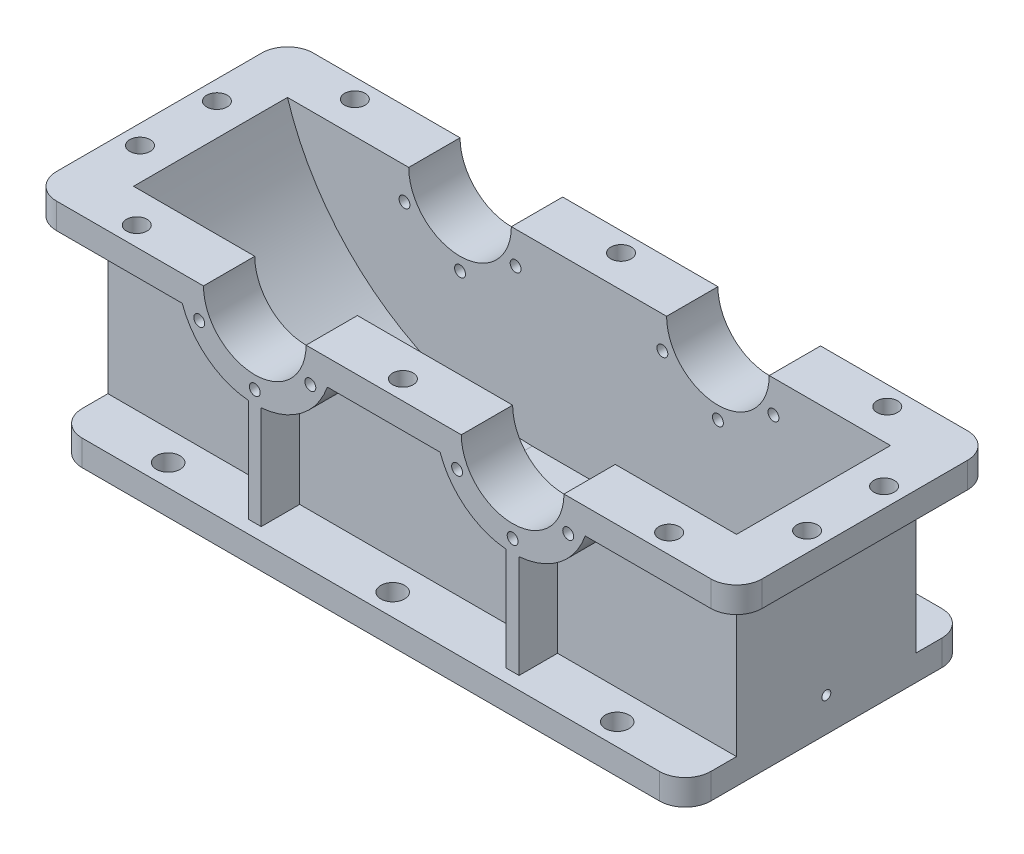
ISO-10303-21;
HEADER;
FILE_DESCRIPTION(('STEP AP214'),'2;1');
FILE_NAME('part.step','',(''),(''),'','','');
FILE_SCHEMA(('AUTOMOTIVE_DESIGN { 1 0 10303 214 1 1 1 1 }'));
ENDSEC;
DATA;
#1=APPLICATION_CONTEXT('core data for automotive mechanical design processes');
#2=APPLICATION_PROTOCOL_DEFINITION('international standard','automotive_design',2000,#1);
#3=PRODUCT_CONTEXT('',#1,'mechanical');
#4=PRODUCT('Part','Part','',(#3));
#5=PRODUCT_RELATED_PRODUCT_CATEGORY('part','',(#4));
#6=PRODUCT_DEFINITION_FORMATION('','',#4);
#7=PRODUCT_DEFINITION_CONTEXT('part definition',#1,'design');
#8=PRODUCT_DEFINITION('design','',#6,#7);
#9=PRODUCT_DEFINITION_SHAPE('','',#8);
#10=(LENGTH_UNIT() NAMED_UNIT(*) SI_UNIT(.MILLI.,.METRE.));
#11=(NAMED_UNIT(*) PLANE_ANGLE_UNIT() SI_UNIT($,.RADIAN.));
#12=(NAMED_UNIT(*) SI_UNIT($,.STERADIAN.) SOLID_ANGLE_UNIT());
#13=UNCERTAINTY_MEASURE_WITH_UNIT(LENGTH_MEASURE(1.E-05),#10,'distance_accuracy_value','');
#14=(GEOMETRIC_REPRESENTATION_CONTEXT(3) GLOBAL_UNCERTAINTY_ASSIGNED_CONTEXT((#13)) GLOBAL_UNIT_ASSIGNED_CONTEXT((#10,
#11,#12)) REPRESENTATION_CONTEXT('',''));
#15=CARTESIAN_POINT('',(0.,0.,0.));
#16=DIRECTION('',(0.,0.,1.));
#17=DIRECTION('',(1.,0.,0.));
#18=AXIS2_PLACEMENT_3D('',#15,#16,#17);
#19=CARTESIAN_POINT('',(0.,20.,-110.));
#20=DIRECTION('',(0.,-1.,0.));
#21=DIRECTION('',(0.,0.,-1.));
#22=AXIS2_PLACEMENT_3D('',#19,#20,#21);
#23=PLANE('',#22);
#24=DIRECTION('',(1.,0.,0.));
#25=VECTOR('',#24,1.);
#26=CARTESIAN_POINT('',(490.,20.,110.));
#27=LINE('',#26,#25);
#28=CARTESIAN_POINT('',(20.,20.,110.));
#29=VERTEX_POINT('',#28);
#30=CARTESIAN_POINT('',(470.,20.,110.));
#31=VERTEX_POINT('',#30);
#32=EDGE_CURVE('E739',#29,#31,#27,.T.);
#33=ORIENTED_EDGE('',*,*,#32,.T.);
#34=CARTESIAN_POINT('',(470.,20.,89.9999999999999));
#35=DIRECTION('',(0.,-1.,0.));
#36=DIRECTION('',(0.,0.,-1.));
#37=AXIS2_PLACEMENT_3D('',#34,#35,#36);
#38=CIRCLE('',#37,20.);
#39=CARTESIAN_POINT('',(490.,20.,89.9999999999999));
#40=VERTEX_POINT('',#39);
#41=EDGE_CURVE('E775',#31,#40,#38,.F.);
#42=ORIENTED_EDGE('',*,*,#41,.T.);
#43=DIRECTION('',(0.,0.,-1.));
#44=VECTOR('',#43,1.);
#45=CARTESIAN_POINT('',(490.,20.,-110.));
#46=LINE('',#45,#44);
#47=CARTESIAN_POINT('',(490.,20.,70.));
#48=VERTEX_POINT('',#47);
#49=EDGE_CURVE('E753',#40,#48,#46,.T.);
#50=ORIENTED_EDGE('',*,*,#49,.T.);
#51=DIRECTION('',(1.,0.,0.));
#52=VECTOR('',#51,1.);
#53=CARTESIAN_POINT('',(490.,20.,70.));
#54=LINE('',#53,#52);
#55=CARTESIAN_POINT('',(350.5,20.,70.));
#56=VERTEX_POINT('',#55);
#57=EDGE_CURVE('E672',#56,#48,#54,.T.);
#58=ORIENTED_EDGE('',*,*,#57,.F.);
#59=DIRECTION('',(0.,0.,-1.));
#60=VECTOR('',#59,1.);
#61=CARTESIAN_POINT('',(350.5,20.,100.));
#62=LINE('',#61,#60);
#63=CARTESIAN_POINT('',(350.5,20.,100.));
#64=VERTEX_POINT('',#63);
#65=EDGE_CURVE('E518',#64,#56,#62,.T.);
#66=ORIENTED_EDGE('',*,*,#65,.F.);
#67=DIRECTION('',(1.,0.,0.));
#68=VECTOR('',#67,1.);
#69=CARTESIAN_POINT('',(340.5,20.,100.));
#70=LINE('',#69,#68);
#71=CARTESIAN_POINT('',(340.5,20.,100.));
#72=VERTEX_POINT('',#71);
#73=EDGE_CURVE('E505',#72,#64,#70,.T.);
#74=ORIENTED_EDGE('',*,*,#73,.F.);
#75=DIRECTION('',(0.,0.,-1.));
#76=VECTOR('',#75,1.);
#77=CARTESIAN_POINT('',(340.5,20.,100.));
#78=LINE('',#77,#76);
#79=CARTESIAN_POINT('',(340.5,20.,70.));
#80=VERTEX_POINT('',#79);
#81=EDGE_CURVE('E520',#72,#80,#78,.T.);
#82=ORIENTED_EDGE('',*,*,#81,.T.);
#83=CARTESIAN_POINT('',(149.5,20.,70.));
#84=VERTEX_POINT('',#83);
#85=EDGE_CURVE('E685',#84,#80,#54,.T.);
#86=ORIENTED_EDGE('',*,*,#85,.F.);
#87=DIRECTION('',(0.,0.,-1.));
#88=VECTOR('',#87,1.);
#89=CARTESIAN_POINT('',(149.5,20.,100.));
#90=LINE('',#89,#88);
#91=CARTESIAN_POINT('',(149.5,20.,100.));
#92=VERTEX_POINT('',#91);
#93=EDGE_CURVE('E552',#92,#84,#90,.T.);
#94=ORIENTED_EDGE('',*,*,#93,.F.);
#95=DIRECTION('',(1.,0.,0.));
#96=VECTOR('',#95,1.);
#97=CARTESIAN_POINT('',(139.5,20.,100.));
#98=LINE('',#97,#96);
#99=CARTESIAN_POINT('',(139.5,20.,100.));
#100=VERTEX_POINT('',#99);
#101=EDGE_CURVE('E536',#100,#92,#98,.T.);
#102=ORIENTED_EDGE('',*,*,#101,.F.);
#103=DIRECTION('',(0.,0.,-1.));
#104=VECTOR('',#103,1.);
#105=CARTESIAN_POINT('',(139.5,20.,100.));
#106=LINE('',#105,#104);
#107=CARTESIAN_POINT('',(139.5,20.,70.));
#108=VERTEX_POINT('',#107);
#109=EDGE_CURVE('E554',#100,#108,#106,.T.);
#110=ORIENTED_EDGE('',*,*,#109,.T.);
#111=CARTESIAN_POINT('',(0.,20.,70.));
#112=VERTEX_POINT('',#111);
#113=EDGE_CURVE('E680',#112,#108,#54,.T.);
#114=ORIENTED_EDGE('',*,*,#113,.F.);
#115=DIRECTION('',(0.,0.,1.));
#116=VECTOR('',#115,1.);
#117=CARTESIAN_POINT('',(0.,20.,110.));
#118=LINE('',#117,#116);
#119=CARTESIAN_POINT('',(0.,20.,90.));
#120=VERTEX_POINT('',#119);
#121=EDGE_CURVE('E740',#112,#120,#118,.T.);
#122=ORIENTED_EDGE('',*,*,#121,.T.);
#123=CARTESIAN_POINT('',(20.,20.,90.));
#124=DIRECTION('',(0.,-1.,0.));
#125=DIRECTION('',(0.,0.,-1.));
#126=AXIS2_PLACEMENT_3D('',#123,#124,#125);
#127=CIRCLE('',#126,20.);
#128=EDGE_CURVE('E773',#120,#29,#127,.F.);
#129=ORIENTED_EDGE('',*,*,#128,.T.);
#130=EDGE_LOOP('',(#33,#42,#50,#58,#66,#74,#82,#86,#94,#102,#110,#114,#122,#129));
#131=FACE_BOUND('',#130,.T.);
#132=CARTESIAN_POINT('',(420.,20.,93.));
#133=DIRECTION('',(0.,1.,0.));
#134=DIRECTION('',(0.,0.,1.));
#135=AXIS2_PLACEMENT_3D('',#132,#133,#134);
#136=CIRCLE('',#135,9.24999999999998);
#137=CARTESIAN_POINT('',(420.,20.,102.25));
#138=VERTEX_POINT('',#137);
#139=EDGE_CURVE('E1988',#138,#138,#136,.T.);
#140=ORIENTED_EDGE('',*,*,#139,.F.);
#141=EDGE_LOOP('',(#140));
#142=FACE_BOUND('',#141,.T.);
#143=CARTESIAN_POINT('',(245.,20.,93.));
#144=DIRECTION('',(0.,1.,0.));
#145=DIRECTION('',(0.,0.,1.));
#146=AXIS2_PLACEMENT_3D('',#143,#144,#145);
#147=CIRCLE('',#146,9.24999999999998);
#148=CARTESIAN_POINT('',(245.,20.,102.25));
#149=VERTEX_POINT('',#148);
#150=EDGE_CURVE('E1994',#149,#149,#147,.T.);
#151=ORIENTED_EDGE('',*,*,#150,.F.);
#152=EDGE_LOOP('',(#151));
#153=FACE_BOUND('',#152,.T.);
#154=CARTESIAN_POINT('',(70.,20.,93.));
#155=DIRECTION('',(0.,1.,0.));
#156=DIRECTION('',(0.,0.,1.));
#157=AXIS2_PLACEMENT_3D('',#154,#155,#156);
#158=CIRCLE('',#157,9.24999999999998);
#159=CARTESIAN_POINT('',(70.,20.,102.25));
#160=VERTEX_POINT('',#159);
#161=EDGE_CURVE('E2000',#160,#160,#158,.T.);
#162=ORIENTED_EDGE('',*,*,#161,.F.);
#163=EDGE_LOOP('',(#162));
#164=FACE_BOUND('',#163,.T.);
#165=ADVANCED_FACE('F50',(#131,#142,#153,#164),#23,.F.);
#166=CARTESIAN_POINT('',(420.,20.,-93.0000000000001));
#167=DIRECTION('',(0.,1.,0.));
#168=DIRECTION('',(0.,0.,1.));
#169=AXIS2_PLACEMENT_3D('',#166,#167,#168);
#170=CIRCLE('',#169,9.24999999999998);
#171=CARTESIAN_POINT('',(420.,20.,-83.7500000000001));
#172=VERTEX_POINT('',#171);
#173=EDGE_CURVE('E1982',#172,#172,#170,.T.);
#174=ORIENTED_EDGE('',*,*,#173,.F.);
#175=EDGE_LOOP('',(#174));
#176=FACE_BOUND('',#175,.T.);
#177=DIRECTION('',(-1.,0.,0.));
#178=VECTOR('',#177,1.);
#179=CARTESIAN_POINT('',(0.,20.,-110.));
#180=LINE('',#179,#178);
#181=CARTESIAN_POINT('',(470.,20.,-110.));
#182=VERTEX_POINT('',#181);
#183=CARTESIAN_POINT('',(20.,20.,-110.));
#184=VERTEX_POINT('',#183);
#185=EDGE_CURVE('E702',#182,#184,#180,.T.);
#186=ORIENTED_EDGE('',*,*,#185,.T.);
#187=CARTESIAN_POINT('',(20.,20.,-90.));
#188=DIRECTION('',(0.,-1.,0.));
#189=DIRECTION('',(0.,0.,-1.));
#190=AXIS2_PLACEMENT_3D('',#187,#188,#189);
#191=CIRCLE('',#190,20.);
#192=CARTESIAN_POINT('',(0.,20.,-90.));
#193=VERTEX_POINT('',#192);
#194=EDGE_CURVE('E761',#184,#193,#191,.F.);
#195=ORIENTED_EDGE('',*,*,#194,.T.);
#196=CARTESIAN_POINT('',(0.,20.,-70.));
#197=VERTEX_POINT('',#196);
#198=EDGE_CURVE('E737',#193,#197,#118,.T.);
#199=ORIENTED_EDGE('',*,*,#198,.T.);
#200=DIRECTION('',(-1.,0.,0.));
#201=VECTOR('',#200,1.);
#202=CARTESIAN_POINT('',(0.,20.,-70.0000000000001));
#203=LINE('',#202,#201);
#204=CARTESIAN_POINT('',(139.5,20.,-70.));
#205=VERTEX_POINT('',#204);
#206=EDGE_CURVE('E693',#205,#197,#203,.T.);
#207=ORIENTED_EDGE('',*,*,#206,.F.);
#208=DIRECTION('',(0.,0.,1.));
#209=VECTOR('',#208,1.);
#210=CARTESIAN_POINT('',(139.5,20.,-100.));
#211=LINE('',#210,#209);
#212=CARTESIAN_POINT('',(139.5,20.,-100.));
#213=VERTEX_POINT('',#212);
#214=EDGE_CURVE('E483',#213,#205,#211,.T.);
#215=ORIENTED_EDGE('',*,*,#214,.F.);
#216=DIRECTION('',(1.,0.,0.));
#217=VECTOR('',#216,1.);
#218=CARTESIAN_POINT('',(139.5,20.,-100.));
#219=LINE('',#218,#217);
#220=CARTESIAN_POINT('',(149.5,20.,-100.));
#221=VERTEX_POINT('',#220);
#222=EDGE_CURVE('E463',#213,#221,#219,.T.);
#223=ORIENTED_EDGE('',*,*,#222,.T.);
#224=DIRECTION('',(0.,0.,1.));
#225=VECTOR('',#224,1.);
#226=CARTESIAN_POINT('',(149.5,20.,-100.));
#227=LINE('',#226,#225);
#228=CARTESIAN_POINT('',(149.5,20.,-70.));
#229=VERTEX_POINT('',#228);
#230=EDGE_CURVE('E485',#221,#229,#227,.T.);
#231=ORIENTED_EDGE('',*,*,#230,.T.);
#232=CARTESIAN_POINT('',(340.5,20.,-70.));
#233=VERTEX_POINT('',#232);
#234=EDGE_CURVE('E696',#233,#229,#203,.T.);
#235=ORIENTED_EDGE('',*,*,#234,.F.);
#236=DIRECTION('',(0.,0.,1.));
#237=VECTOR('',#236,1.);
#238=CARTESIAN_POINT('',(340.5,20.,-100.));
#239=LINE('',#238,#237);
#240=CARTESIAN_POINT('',(340.5,20.,-100.));
#241=VERTEX_POINT('',#240);
#242=EDGE_CURVE('E448',#241,#233,#239,.T.);
#243=ORIENTED_EDGE('',*,*,#242,.F.);
#244=DIRECTION('',(1.,0.,0.));
#245=VECTOR('',#244,1.);
#246=CARTESIAN_POINT('',(340.5,20.,-100.));
#247=LINE('',#246,#245);
#248=CARTESIAN_POINT('',(350.5,20.,-100.));
#249=VERTEX_POINT('',#248);
#250=EDGE_CURVE('E427',#241,#249,#247,.T.);
#251=ORIENTED_EDGE('',*,*,#250,.T.);
#252=DIRECTION('',(0.,0.,1.));
#253=VECTOR('',#252,1.);
#254=CARTESIAN_POINT('',(350.5,20.,-100.));
#255=LINE('',#254,#253);
#256=CARTESIAN_POINT('',(350.5,20.,-70.));
#257=VERTEX_POINT('',#256);
#258=EDGE_CURVE('E413',#249,#257,#255,.T.);
#259=ORIENTED_EDGE('',*,*,#258,.T.);
#260=CARTESIAN_POINT('',(490.,20.,-70.));
#261=VERTEX_POINT('',#260);
#262=EDGE_CURVE('E698',#261,#257,#203,.T.);
#263=ORIENTED_EDGE('',*,*,#262,.F.);
#264=CARTESIAN_POINT('',(490.,20.,-90.0000000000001));
#265=VERTEX_POINT('',#264);
#266=EDGE_CURVE('E751',#261,#265,#46,.T.);
#267=ORIENTED_EDGE('',*,*,#266,.T.);
#268=CARTESIAN_POINT('',(470.,20.,-90.0000000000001));
#269=DIRECTION('',(0.,-1.,0.));
#270=DIRECTION('',(0.,0.,-1.));
#271=AXIS2_PLACEMENT_3D('',#268,#269,#270);
#272=CIRCLE('',#271,20.);
#273=EDGE_CURVE('E925',#265,#182,#272,.F.);
#274=ORIENTED_EDGE('',*,*,#273,.T.);
#275=EDGE_LOOP('',(#186,#195,#199,#207,#215,#223,#231,#235,#243,#251,#259,#263,#267,#274));
#276=FACE_BOUND('',#275,.T.);
#277=CARTESIAN_POINT('',(70.,20.,-93.0000000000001));
#278=DIRECTION('',(0.,1.,0.));
#279=DIRECTION('',(0.,0.,1.));
#280=AXIS2_PLACEMENT_3D('',#277,#278,#279);
#281=CIRCLE('',#280,9.24999999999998);
#282=CARTESIAN_POINT('',(70.,20.,-83.7500000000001));
#283=VERTEX_POINT('',#282);
#284=EDGE_CURVE('E1970',#283,#283,#281,.T.);
#285=ORIENTED_EDGE('',*,*,#284,.F.);
#286=EDGE_LOOP('',(#285));
#287=FACE_BOUND('',#286,.T.);
#288=CARTESIAN_POINT('',(245.,20.,-93.0000000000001));
#289=DIRECTION('',(0.,1.,0.));
#290=DIRECTION('',(0.,0.,1.));
#291=AXIS2_PLACEMENT_3D('',#288,#289,#290);
#292=CIRCLE('',#291,9.24999999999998);
#293=CARTESIAN_POINT('',(245.,20.,-83.7500000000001));
#294=VERTEX_POINT('',#293);
#295=EDGE_CURVE('E1976',#294,#294,#292,.T.);
#296=ORIENTED_EDGE('',*,*,#295,.F.);
#297=EDGE_LOOP('',(#296));
#298=FACE_BOUND('',#297,.T.);
#299=ADVANCED_FACE('F919',(#176,#276,#287,#298),#23,.F.);
#300=CARTESIAN_POINT('',(0.,160.,-70.));
#301=DIRECTION('',(0.,-1.,0.));
#302=DIRECTION('',(0.,0.,-1.));
#303=AXIS2_PLACEMENT_3D('',#300,#301,#302);
#304=PLANE('',#303);
#305=DIRECTION('',(-1.,0.,0.));
#306=VECTOR('',#305,1.);
#307=CARTESIAN_POINT('',(-30.,160.,-100.));
#308=LINE('',#307,#306);
#309=CARTESIAN_POINT('',(305.5,160.,-100.));
#310=VERTEX_POINT('',#309);
#311=CARTESIAN_POINT('',(184.5,160.,-100.));
#312=VERTEX_POINT('',#311);
#313=EDGE_CURVE('E629',#310,#312,#308,.T.);
#314=ORIENTED_EDGE('',*,*,#313,.T.);
#315=DIRECTION('',(0.,0.,-1.));
#316=VECTOR('',#315,1.);
#317=CARTESIAN_POINT('',(184.5,160.,110.));
#318=LINE('',#317,#316);
#319=CARTESIAN_POINT('',(184.5,160.,-60.0000000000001));
#320=VERTEX_POINT('',#319);
#321=EDGE_CURVE('E589',#320,#312,#318,.T.);
#322=ORIENTED_EDGE('',*,*,#321,.F.);
#323=DIRECTION('',(-1.,0.,0.));
#324=VECTOR('',#323,1.);
#325=CARTESIAN_POINT('',(9.99999999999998,160.,-60.0000000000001));
#326=LINE('',#325,#324);
#327=CARTESIAN_POINT('',(305.5,160.,-60.));
#328=VERTEX_POINT('',#327);
#329=EDGE_CURVE('E662',#328,#320,#326,.T.);
#330=ORIENTED_EDGE('',*,*,#329,.F.);
#331=DIRECTION('',(0.,0.,-1.));
#332=VECTOR('',#331,1.);
#333=CARTESIAN_POINT('',(305.5,160.,110.));
#334=LINE('',#333,#332);
#335=EDGE_CURVE('E574',#310,#328,#334,.F.);
#336=ORIENTED_EDGE('',*,*,#335,.F.);
#337=EDGE_LOOP('',(#314,#322,#330,#336));
#338=FACE_BOUND('',#337,.T.);
#339=CARTESIAN_POINT('',(245.,160.,-85.));
#340=DIRECTION('',(0.,1.,0.));
#341=DIRECTION('',(0.,0.,1.));
#342=AXIS2_PLACEMENT_3D('',#339,#340,#341);
#343=CIRCLE('',#342,7.99999999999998);
#344=CARTESIAN_POINT('',(245.,160.,-77.));
#345=VERTEX_POINT('',#344);
#346=EDGE_CURVE('E1958',#345,#345,#343,.T.);
#347=ORIENTED_EDGE('',*,*,#346,.F.);
#348=EDGE_LOOP('',(#347));
#349=FACE_BOUND('',#348,.T.);
#350=ADVANCED_FACE('F811',(#338,#349),#304,.F.);
#351=CARTESIAN_POINT('',(0.,160.,-70.));
#352=DIRECTION('',(0.,0.,1.));
#353=DIRECTION('',(1.,0.,0.));
#354=AXIS2_PLACEMENT_3D('',#351,#352,#353);
#355=PLANE('',#354);
#356=DIRECTION('',(0.,1.,0.));
#357=VECTOR('',#356,1.);
#358=CARTESIAN_POINT('',(350.5,100.208696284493,-70.));
#359=LINE('',#358,#357);
#360=CARTESIAN_POINT('',(350.5,100.208696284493,-70.));
#361=VERTEX_POINT('',#360);
#362=EDGE_CURVE('E439',#257,#361,#359,.T.);
#363=ORIENTED_EDGE('',*,*,#362,.T.);
#364=CARTESIAN_POINT('',(345.5,160.,-70.));
#365=DIRECTION('',(0.,0.,1.));
#366=DIRECTION('',(-1.,0.,0.));
#367=AXIS2_PLACEMENT_3D('',#364,#365,#366);
#368=CIRCLE('',#367,59.9999999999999);
#369=CARTESIAN_POINT('',(402.068542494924,140.,-70.));
#370=VERTEX_POINT('',#369);
#371=EDGE_CURVE('E408',#361,#370,#368,.T.);
#372=ORIENTED_EDGE('',*,*,#371,.T.);
#373=DIRECTION('',(-1.,0.,0.));
#374=VECTOR('',#373,1.);
#375=CARTESIAN_POINT('',(0.,140.,-70.));
#376=LINE('',#375,#374);
#377=CARTESIAN_POINT('',(490.,140.,-70.));
#378=VERTEX_POINT('',#377);
#379=EDGE_CURVE('E630',#378,#370,#376,.T.);
#380=ORIENTED_EDGE('',*,*,#379,.F.);
#381=DIRECTION('',(0.,-1.,0.));
#382=VECTOR('',#381,1.);
#383=CARTESIAN_POINT('',(490.,160.,-70.));
#384=LINE('',#383,#382);
#385=EDGE_CURVE('E889',#378,#261,#384,.T.);
#386=ORIENTED_EDGE('',*,*,#385,.T.);
#387=ORIENTED_EDGE('',*,*,#262,.T.);
#388=EDGE_LOOP('',(#363,#372,#380,#386,#387));
#389=FACE_BOUND('',#388,.T.);
#390=ADVANCED_FACE('F1018',(#389),#355,.F.);
#391=CARTESIAN_POINT('',(345.5,160.,-70.));
#392=DIRECTION('',(0.,0.,1.));
#393=DIRECTION('',(-1.,0.,0.));
#394=AXIS2_PLACEMENT_3D('',#391,#392,#393);
#395=CIRCLE('',#394,59.9999999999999);
#396=CARTESIAN_POINT('',(288.931457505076,140.,-70.));
#397=VERTEX_POINT('',#396);
#398=CARTESIAN_POINT('',(340.5,100.208696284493,-70.));
#399=VERTEX_POINT('',#398);
#400=EDGE_CURVE('E423',#397,#399,#395,.T.);
#401=ORIENTED_EDGE('',*,*,#400,.T.);
#402=DIRECTION('',(0.,-1.,0.));
#403=VECTOR('',#402,1.);
#404=CARTESIAN_POINT('',(340.5,100.208696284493,-70.));
#405=LINE('',#404,#403);
#406=EDGE_CURVE('E442',#399,#233,#405,.T.);
#407=ORIENTED_EDGE('',*,*,#406,.T.);
#408=ORIENTED_EDGE('',*,*,#234,.T.);
#409=DIRECTION('',(0.,1.,0.));
#410=VECTOR('',#409,1.);
#411=CARTESIAN_POINT('',(149.5,100.208696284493,-70.));
#412=LINE('',#411,#410);
#413=CARTESIAN_POINT('',(149.5,100.208696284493,-70.));
#414=VERTEX_POINT('',#413);
#415=EDGE_CURVE('E474',#229,#414,#412,.T.);
#416=ORIENTED_EDGE('',*,*,#415,.T.);
#417=CARTESIAN_POINT('',(144.5,160.,-70.));
#418=DIRECTION('',(0.,0.,1.));
#419=DIRECTION('',(1.,0.,0.));
#420=AXIS2_PLACEMENT_3D('',#417,#418,#419);
#421=CIRCLE('',#420,59.9999999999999);
#422=CARTESIAN_POINT('',(201.068542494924,140.,-70.));
#423=VERTEX_POINT('',#422);
#424=EDGE_CURVE('E455',#414,#423,#421,.T.);
#425=ORIENTED_EDGE('',*,*,#424,.T.);
#426=EDGE_CURVE('E634',#397,#423,#376,.T.);
#427=ORIENTED_EDGE('',*,*,#426,.F.);
#428=EDGE_LOOP('',(#401,#407,#408,#416,#425,#427));
#429=FACE_BOUND('',#428,.T.);
#430=ADVANCED_FACE('F1019',(#429),#355,.F.);
#431=CARTESIAN_POINT('',(0.,140.,0.));
#432=DIRECTION('',(0.,1.,0.));
#433=DIRECTION('',(0.,0.,1.));
#434=AXIS2_PLACEMENT_3D('',#431,#432,#433);
#435=PLANE('',#434);
#436=CARTESIAN_POINT('',(245.,140.,85.));
#437=DIRECTION('',(0.,1.,0.));
#438=DIRECTION('',(0.,0.,1.));
#439=AXIS2_PLACEMENT_3D('',#436,#437,#438);
#440=CIRCLE('',#439,7.99999999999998);
#441=CARTESIAN_POINT('',(245.,140.,93.));
#442=VERTEX_POINT('',#441);
#443=EDGE_CURVE('E1829',#442,#442,#440,.T.);
#444=ORIENTED_EDGE('',*,*,#443,.T.);
#445=EDGE_LOOP('',(#444));
#446=FACE_BOUND('',#445,.T.);
#447=DIRECTION('',(0.,0.,-1.));
#448=VECTOR('',#447,1.);
#449=CARTESIAN_POINT('',(288.931457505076,140.,100.));
#450=LINE('',#449,#448);
#451=CARTESIAN_POINT('',(288.931457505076,140.,100.));
#452=VERTEX_POINT('',#451);
#453=CARTESIAN_POINT('',(288.931457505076,140.,70.));
#454=VERTEX_POINT('',#453);
#455=EDGE_CURVE('E526',#452,#454,#450,.T.);
#456=ORIENTED_EDGE('',*,*,#455,.F.);
#457=DIRECTION('',(1.,0.,0.));
#458=VECTOR('',#457,1.);
#459=CARTESIAN_POINT('',(-30.,140.,100.));
#460=LINE('',#459,#458);
#461=CARTESIAN_POINT('',(201.068542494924,140.,100.));
#462=VERTEX_POINT('',#461);
#463=EDGE_CURVE('E611',#462,#452,#460,.T.);
#464=ORIENTED_EDGE('',*,*,#463,.F.);
#465=DIRECTION('',(0.,0.,-1.));
#466=VECTOR('',#465,1.);
#467=CARTESIAN_POINT('',(201.068542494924,140.,100.));
#468=LINE('',#467,#466);
#469=CARTESIAN_POINT('',(201.068542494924,140.,70.));
#470=VERTEX_POINT('',#469);
#471=EDGE_CURVE('E562',#470,#462,#468,.F.);
#472=ORIENTED_EDGE('',*,*,#471,.F.);
#473=DIRECTION('',(1.,0.,0.));
#474=VECTOR('',#473,1.);
#475=CARTESIAN_POINT('',(490.,140.,70.));
#476=LINE('',#475,#474);
#477=EDGE_CURVE('E645',#470,#454,#476,.T.);
#478=ORIENTED_EDGE('',*,*,#477,.T.);
#479=EDGE_LOOP('',(#456,#464,#472,#478));
#480=FACE_BOUND('',#479,.T.);
#481=ADVANCED_FACE('F849',(#446,#480),#435,.F.);
#482=CARTESIAN_POINT('',(490.,160.,70.));
#483=DIRECTION('',(0.,0.,-1.));
#484=DIRECTION('',(-1.,0.,0.));
#485=AXIS2_PLACEMENT_3D('',#482,#483,#484);
#486=PLANE('',#485);
#487=CARTESIAN_POINT('',(345.5,160.,70.));
#488=DIRECTION('',(0.,0.,1.));
#489=DIRECTION('',(-1.,0.,0.));
#490=AXIS2_PLACEMENT_3D('',#487,#488,#489);
#491=CIRCLE('',#490,59.9999999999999);
#492=CARTESIAN_POINT('',(340.5,100.208696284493,70.));
#493=VERTEX_POINT('',#492);
#494=EDGE_CURVE('E511',#454,#493,#491,.T.);
#495=ORIENTED_EDGE('',*,*,#494,.F.);
#496=ORIENTED_EDGE('',*,*,#477,.F.);
#497=CARTESIAN_POINT('',(144.5,160.,70.));
#498=DIRECTION('',(0.,0.,1.));
#499=DIRECTION('',(1.,0.,0.));
#500=AXIS2_PLACEMENT_3D('',#497,#498,#499);
#501=CIRCLE('',#500,59.9999999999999);
#502=CARTESIAN_POINT('',(149.5,100.208696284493,70.));
#503=VERTEX_POINT('',#502);
#504=EDGE_CURVE('E534',#503,#470,#501,.T.);
#505=ORIENTED_EDGE('',*,*,#504,.F.);
#506=DIRECTION('',(0.,1.,0.));
#507=VECTOR('',#506,1.);
#508=CARTESIAN_POINT('',(149.5,100.208696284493,70.));
#509=LINE('',#508,#507);
#510=EDGE_CURVE('E547',#84,#503,#509,.T.);
#511=ORIENTED_EDGE('',*,*,#510,.F.);
#512=ORIENTED_EDGE('',*,*,#85,.T.);
#513=DIRECTION('',(0.,-1.,0.));
#514=VECTOR('',#513,1.);
#515=CARTESIAN_POINT('',(340.5,100.208696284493,70.));
#516=LINE('',#515,#514);
#517=EDGE_CURVE('E513',#493,#80,#516,.T.);
#518=ORIENTED_EDGE('',*,*,#517,.F.);
#519=EDGE_LOOP('',(#495,#496,#505,#511,#512,#518));
#520=FACE_BOUND('',#519,.T.);
#521=ADVANCED_FACE('F857',(#520),#486,.F.);
#522=CARTESIAN_POINT('',(345.5,160.,70.));
#523=DIRECTION('',(0.,0.,1.));
#524=DIRECTION('',(-1.,0.,0.));
#525=AXIS2_PLACEMENT_3D('',#522,#523,#524);
#526=CIRCLE('',#525,59.9999999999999);
#527=CARTESIAN_POINT('',(350.5,100.208696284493,70.));
#528=VERTEX_POINT('',#527);
#529=CARTESIAN_POINT('',(402.068542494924,140.,70.));
#530=VERTEX_POINT('',#529);
#531=EDGE_CURVE('E496',#528,#530,#526,.T.);
#532=ORIENTED_EDGE('',*,*,#531,.F.);
#533=DIRECTION('',(0.,1.,0.));
#534=VECTOR('',#533,1.);
#535=CARTESIAN_POINT('',(350.5,100.208696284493,70.));
#536=LINE('',#535,#534);
#537=EDGE_CURVE('E501',#56,#528,#536,.T.);
#538=ORIENTED_EDGE('',*,*,#537,.F.);
#539=ORIENTED_EDGE('',*,*,#57,.T.);
#540=DIRECTION('',(0.,-1.,0.));
#541=VECTOR('',#540,1.);
#542=CARTESIAN_POINT('',(490.,160.,70.));
#543=LINE('',#542,#541);
#544=CARTESIAN_POINT('',(490.,140.,70.));
#545=VERTEX_POINT('',#544);
#546=EDGE_CURVE('E886',#545,#48,#543,.T.);
#547=ORIENTED_EDGE('',*,*,#546,.F.);
#548=EDGE_CURVE('E640',#530,#545,#476,.T.);
#549=ORIENTED_EDGE('',*,*,#548,.F.);
#550=EDGE_LOOP('',(#532,#538,#539,#547,#549));
#551=FACE_BOUND('',#550,.T.);
#552=ADVANCED_FACE('F884',(#551),#486,.F.);
#553=CARTESIAN_POINT('',(452.5,140.,-85.));
#554=DIRECTION('',(0.,1.,0.));
#555=DIRECTION('',(0.,0.,1.));
#556=AXIS2_PLACEMENT_3D('',#553,#554,#555);
#557=CIRCLE('',#556,8.00000000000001);
#558=CARTESIAN_POINT('',(452.5,140.,-77.));
#559=VERTEX_POINT('',#558);
#560=EDGE_CURVE('E1949',#559,#559,#557,.T.);
#561=ORIENTED_EDGE('',*,*,#560,.T.);
#562=EDGE_LOOP('',(#561));
#563=FACE_BOUND('',#562,.T.);
#564=CARTESIAN_POINT('',(452.5,140.,85.));
#565=DIRECTION('',(0.,1.,0.));
#566=DIRECTION('',(0.,0.,1.));
#567=AXIS2_PLACEMENT_3D('',#564,#565,#566);
#568=CIRCLE('',#567,8.00000000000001);
#569=CARTESIAN_POINT('',(452.5,140.,93.));
#570=VERTEX_POINT('',#569);
#571=EDGE_CURVE('E1837',#570,#570,#568,.T.);
#572=ORIENTED_EDGE('',*,*,#571,.T.);
#573=EDGE_LOOP('',(#572));
#574=FACE_BOUND('',#573,.T.);
#575=CARTESIAN_POINT('',(505.,140.,-30.));
#576=DIRECTION('',(0.,1.,0.));
#577=DIRECTION('',(0.,0.,1.));
#578=AXIS2_PLACEMENT_3D('',#575,#576,#577);
#579=CIRCLE('',#578,8.00000000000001);
#580=CARTESIAN_POINT('',(505.,140.,-22.));
#581=VERTEX_POINT('',#580);
#582=EDGE_CURVE('E1858',#581,#581,#579,.T.);
#583=ORIENTED_EDGE('',*,*,#582,.T.);
#584=EDGE_LOOP('',(#583));
#585=FACE_BOUND('',#584,.T.);
#586=CARTESIAN_POINT('',(505.,140.,30.));
#587=DIRECTION('',(0.,1.,0.));
#588=DIRECTION('',(0.,0.,1.));
#589=AXIS2_PLACEMENT_3D('',#586,#587,#588);
#590=CIRCLE('',#589,8.00000000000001);
#591=CARTESIAN_POINT('',(505.,140.,38.));
#592=VERTEX_POINT('',#591);
#593=EDGE_CURVE('E1864',#592,#592,#590,.T.);
#594=ORIENTED_EDGE('',*,*,#593,.T.);
#595=EDGE_LOOP('',(#594));
#596=FACE_BOUND('',#595,.T.);
#597=DIRECTION('',(-1.,0.,0.));
#598=VECTOR('',#597,1.);
#599=CARTESIAN_POINT('',(-30.,140.,-100.));
#600=LINE('',#599,#598);
#601=CARTESIAN_POINT('',(500.,140.,-100.));
#602=VERTEX_POINT('',#601);
#603=CARTESIAN_POINT('',(402.068542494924,140.,-100.));
#604=VERTEX_POINT('',#603);
#605=EDGE_CURVE('E422',#602,#604,#600,.T.);
#606=ORIENTED_EDGE('',*,*,#605,.F.);
#607=CARTESIAN_POINT('',(500.,140.,-80.));
#608=DIRECTION('',(0.,1.,0.));
#609=DIRECTION('',(0.,0.,1.));
#610=AXIS2_PLACEMENT_3D('',#607,#608,#609);
#611=CIRCLE('',#610,20.);
#612=CARTESIAN_POINT('',(520.,140.,-80.));
#613=VERTEX_POINT('',#612);
#614=EDGE_CURVE('E729',#602,#613,#611,.F.);
#615=ORIENTED_EDGE('',*,*,#614,.T.);
#616=DIRECTION('',(0.,0.,-1.));
#617=VECTOR('',#616,1.);
#618=CARTESIAN_POINT('',(520.,140.,-100.));
#619=LINE('',#618,#617);
#620=CARTESIAN_POINT('',(520.,140.,80.));
#621=VERTEX_POINT('',#620);
#622=EDGE_CURVE('E610',#621,#613,#619,.T.);
#623=ORIENTED_EDGE('',*,*,#622,.F.);
#624=CARTESIAN_POINT('',(500.,140.,80.));
#625=DIRECTION('',(0.,1.,0.));
#626=DIRECTION('',(0.,0.,1.));
#627=AXIS2_PLACEMENT_3D('',#624,#625,#626);
#628=CIRCLE('',#627,20.);
#629=CARTESIAN_POINT('',(500.,140.,100.));
#630=VERTEX_POINT('',#629);
#631=EDGE_CURVE('E727',#621,#630,#628,.F.);
#632=ORIENTED_EDGE('',*,*,#631,.T.);
#633=CARTESIAN_POINT('',(402.068542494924,140.,100.));
#634=VERTEX_POINT('',#633);
#635=EDGE_CURVE('E606',#634,#630,#460,.T.);
#636=ORIENTED_EDGE('',*,*,#635,.F.);
#637=DIRECTION('',(0.,0.,-1.));
#638=VECTOR('',#637,1.);
#639=CARTESIAN_POINT('',(402.068542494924,140.,100.));
#640=LINE('',#639,#638);
#641=EDGE_CURVE('E528',#530,#634,#640,.F.);
#642=ORIENTED_EDGE('',*,*,#641,.F.);
#643=ORIENTED_EDGE('',*,*,#548,.T.);
#644=DIRECTION('',(0.,0.,-1.));
#645=VECTOR('',#644,1.);
#646=CARTESIAN_POINT('',(490.,140.,-110.));
#647=LINE('',#646,#645);
#648=EDGE_CURVE('E633',#545,#378,#647,.T.);
#649=ORIENTED_EDGE('',*,*,#648,.T.);
#650=ORIENTED_EDGE('',*,*,#379,.T.);
#651=DIRECTION('',(0.,0.,1.));
#652=VECTOR('',#651,1.);
#653=CARTESIAN_POINT('',(402.068542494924,140.,-100.));
#654=LINE('',#653,#652);
#655=EDGE_CURVE('E453',#370,#604,#654,.F.);
#656=ORIENTED_EDGE('',*,*,#655,.T.);
#657=EDGE_LOOP('',(#606,#615,#623,#632,#636,#642,#643,#649,#650,#656));
#658=FACE_BOUND('',#657,.T.);
#659=ADVANCED_FACE('F825',(#563,#574,#585,#596,#658),#435,.F.);
#660=CARTESIAN_POINT('',(144.5,160.,70.));
#661=DIRECTION('',(0.,0.,1.));
#662=DIRECTION('',(1.,0.,0.));
#663=AXIS2_PLACEMENT_3D('',#660,#661,#662);
#664=CIRCLE('',#663,59.9999999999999);
#665=CARTESIAN_POINT('',(87.9314575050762,140.,70.));
#666=VERTEX_POINT('',#665);
#667=CARTESIAN_POINT('',(139.5,100.208696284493,70.));
#668=VERTEX_POINT('',#667);
#669=EDGE_CURVE('E530',#666,#668,#664,.T.);
#670=ORIENTED_EDGE('',*,*,#669,.F.);
#671=CARTESIAN_POINT('',(0.,140.,70.));
#672=VERTEX_POINT('',#671);
#673=EDGE_CURVE('E641',#672,#666,#476,.T.);
#674=ORIENTED_EDGE('',*,*,#673,.F.);
#675=DIRECTION('',(0.,-1.,0.));
#676=VECTOR('',#675,1.);
#677=CARTESIAN_POINT('',(0.,160.,70.));
#678=LINE('',#677,#676);
#679=EDGE_CURVE('E688',#672,#112,#678,.T.);
#680=ORIENTED_EDGE('',*,*,#679,.T.);
#681=ORIENTED_EDGE('',*,*,#113,.T.);
#682=DIRECTION('',(0.,-1.,0.));
#683=VECTOR('',#682,1.);
#684=CARTESIAN_POINT('',(139.5,100.208696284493,70.));
#685=LINE('',#684,#683);
#686=EDGE_CURVE('E545',#668,#108,#685,.T.);
#687=ORIENTED_EDGE('',*,*,#686,.F.);
#688=EDGE_LOOP('',(#670,#674,#680,#681,#687));
#689=FACE_BOUND('',#688,.T.);
#690=ADVANCED_FACE('F1020',(#689),#486,.F.);
#691=CARTESIAN_POINT('',(37.5,140.,-85.));
#692=DIRECTION('',(0.,1.,0.));
#693=DIRECTION('',(0.,0.,1.));
#694=AXIS2_PLACEMENT_3D('',#691,#692,#693);
#695=CIRCLE('',#694,8.);
#696=CARTESIAN_POINT('',(37.5,140.,-77.));
#697=VERTEX_POINT('',#696);
#698=EDGE_CURVE('E1961',#697,#697,#695,.T.);
#699=ORIENTED_EDGE('',*,*,#698,.T.);
#700=EDGE_LOOP('',(#699));
#701=FACE_BOUND('',#700,.T.);
#702=CARTESIAN_POINT('',(37.5,140.,85.));
#703=DIRECTION('',(0.,1.,0.));
#704=DIRECTION('',(0.,0.,1.));
#705=AXIS2_PLACEMENT_3D('',#702,#703,#704);
#706=CIRCLE('',#705,8.);
#707=CARTESIAN_POINT('',(37.5,140.,93.));
#708=VERTEX_POINT('',#707);
#709=EDGE_CURVE('E1834',#708,#708,#706,.T.);
#710=ORIENTED_EDGE('',*,*,#709,.T.);
#711=EDGE_LOOP('',(#710));
#712=FACE_BOUND('',#711,.T.);
#713=CARTESIAN_POINT('',(-15.,140.,30.));
#714=DIRECTION('',(0.,1.,0.));
#715=DIRECTION('',(0.,0.,1.));
#716=AXIS2_PLACEMENT_3D('',#713,#714,#715);
#717=CIRCLE('',#716,8.);
#718=CARTESIAN_POINT('',(-15.,140.,38.));
#719=VERTEX_POINT('',#718);
#720=EDGE_CURVE('E1846',#719,#719,#717,.T.);
#721=ORIENTED_EDGE('',*,*,#720,.T.);
#722=EDGE_LOOP('',(#721));
#723=FACE_BOUND('',#722,.T.);
#724=CARTESIAN_POINT('',(-15.,140.,-30.));
#725=DIRECTION('',(0.,1.,0.));
#726=DIRECTION('',(0.,0.,1.));
#727=AXIS2_PLACEMENT_3D('',#724,#725,#726);
#728=CIRCLE('',#727,8.);
#729=CARTESIAN_POINT('',(-15.,140.,-22.));
#730=VERTEX_POINT('',#729);
#731=EDGE_CURVE('E1852',#730,#730,#728,.T.);
#732=ORIENTED_EDGE('',*,*,#731,.T.);
#733=EDGE_LOOP('',(#732));
#734=FACE_BOUND('',#733,.T.);
#735=DIRECTION('',(0.,0.,1.));
#736=VECTOR('',#735,1.);
#737=CARTESIAN_POINT('',(-30.,140.,-100.));
#738=LINE('',#737,#736);
#739=CARTESIAN_POINT('',(-30.,140.,-80.));
#740=VERTEX_POINT('',#739);
#741=CARTESIAN_POINT('',(-30.,140.,80.));
#742=VERTEX_POINT('',#741);
#743=EDGE_CURVE('E603',#740,#742,#738,.T.);
#744=ORIENTED_EDGE('',*,*,#743,.F.);
#745=CARTESIAN_POINT('',(-10.,140.,-80.));
#746=DIRECTION('',(0.,1.,0.));
#747=DIRECTION('',(0.,0.,1.));
#748=AXIS2_PLACEMENT_3D('',#745,#746,#747);
#749=CIRCLE('',#748,20.);
#750=CARTESIAN_POINT('',(-10.,140.,-100.));
#751=VERTEX_POINT('',#750);
#752=EDGE_CURVE('E716',#740,#751,#749,.F.);
#753=ORIENTED_EDGE('',*,*,#752,.T.);
#754=CARTESIAN_POINT('',(87.9314575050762,140.,-100.));
#755=VERTEX_POINT('',#754);
#756=EDGE_CURVE('E614',#755,#751,#600,.T.);
#757=ORIENTED_EDGE('',*,*,#756,.F.);
#758=DIRECTION('',(0.,0.,1.));
#759=VECTOR('',#758,1.);
#760=CARTESIAN_POINT('',(87.9314575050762,140.,-100.));
#761=LINE('',#760,#759);
#762=CARTESIAN_POINT('',(87.9314575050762,140.,-70.));
#763=VERTEX_POINT('',#762);
#764=EDGE_CURVE('E490',#755,#763,#761,.T.);
#765=ORIENTED_EDGE('',*,*,#764,.T.);
#766=CARTESIAN_POINT('',(0.,140.,-70.));
#767=VERTEX_POINT('',#766);
#768=EDGE_CURVE('E616',#763,#767,#376,.T.);
#769=ORIENTED_EDGE('',*,*,#768,.T.);
#770=DIRECTION('',(0.,0.,1.));
#771=VECTOR('',#770,1.);
#772=CARTESIAN_POINT('',(0.,140.,110.));
#773=LINE('',#772,#771);
#774=EDGE_CURVE('E637',#767,#672,#773,.T.);
#775=ORIENTED_EDGE('',*,*,#774,.T.);
#776=ORIENTED_EDGE('',*,*,#673,.T.);
#777=DIRECTION('',(0.,0.,-1.));
#778=VECTOR('',#777,1.);
#779=CARTESIAN_POINT('',(87.9314575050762,140.,100.));
#780=LINE('',#779,#778);
#781=CARTESIAN_POINT('',(87.9314575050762,140.,100.));
#782=VERTEX_POINT('',#781);
#783=EDGE_CURVE('E560',#782,#666,#780,.T.);
#784=ORIENTED_EDGE('',*,*,#783,.F.);
#785=CARTESIAN_POINT('',(-9.99999999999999,140.,100.));
#786=VERTEX_POINT('',#785);
#787=EDGE_CURVE('E608',#786,#782,#460,.T.);
#788=ORIENTED_EDGE('',*,*,#787,.F.);
#789=CARTESIAN_POINT('',(-9.99999999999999,140.,80.));
#790=DIRECTION('',(0.,1.,0.));
#791=DIRECTION('',(0.,0.,1.));
#792=AXIS2_PLACEMENT_3D('',#789,#790,#791);
#793=CIRCLE('',#792,20.);
#794=EDGE_CURVE('E714',#786,#742,#793,.F.);
#795=ORIENTED_EDGE('',*,*,#794,.T.);
#796=EDGE_LOOP('',(#744,#753,#757,#765,#769,#775,#776,#784,#788,#795));
#797=FACE_BOUND('',#796,.T.);
#798=ADVANCED_FACE('F1022',(#701,#712,#723,#734,#797),#435,.F.);
#799=CARTESIAN_POINT('',(245.,160.,85.));
#800=DIRECTION('',(0.,1.,0.));
#801=DIRECTION('',(0.,0.,1.));
#802=AXIS2_PLACEMENT_3D('',#799,#800,#801);
#803=CIRCLE('',#802,7.99999999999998);
#804=CARTESIAN_POINT('',(245.,160.,93.));
#805=VERTEX_POINT('',#804);
#806=EDGE_CURVE('E1831',#805,#805,#803,.T.);
#807=ORIENTED_EDGE('',*,*,#806,.F.);
#808=EDGE_LOOP('',(#807));
#809=FACE_BOUND('',#808,.T.);
#810=DIRECTION('',(1.,0.,0.));
#811=VECTOR('',#810,1.);
#812=CARTESIAN_POINT('',(-30.,160.,100.));
#813=LINE('',#812,#811);
#814=CARTESIAN_POINT('',(184.5,160.,100.));
#815=VERTEX_POINT('',#814);
#816=CARTESIAN_POINT('',(305.5,160.,100.));
#817=VERTEX_POINT('',#816);
#818=EDGE_CURVE('E624',#815,#817,#813,.T.);
#819=ORIENTED_EDGE('',*,*,#818,.T.);
#820=CARTESIAN_POINT('',(305.5,160.,60.));
#821=VERTEX_POINT('',#820);
#822=EDGE_CURVE('E569',#821,#817,#334,.F.);
#823=ORIENTED_EDGE('',*,*,#822,.F.);
#824=DIRECTION('',(1.,0.,0.));
#825=VECTOR('',#824,1.);
#826=CARTESIAN_POINT('',(480.,160.,60.));
#827=LINE('',#826,#825);
#828=CARTESIAN_POINT('',(184.5,160.,60.));
#829=VERTEX_POINT('',#828);
#830=EDGE_CURVE('E654',#829,#821,#827,.T.);
#831=ORIENTED_EDGE('',*,*,#830,.F.);
#832=EDGE_CURVE('E586',#815,#829,#318,.T.);
#833=ORIENTED_EDGE('',*,*,#832,.F.);
#834=EDGE_LOOP('',(#819,#823,#831,#833));
#835=FACE_BOUND('',#834,.T.);
#836=ADVANCED_FACE('F1028',(#809,#835),#304,.F.);
#837=CARTESIAN_POINT('',(452.5,160.,-85.));
#838=DIRECTION('',(0.,1.,0.));
#839=DIRECTION('',(0.,0.,1.));
#840=AXIS2_PLACEMENT_3D('',#837,#838,#839);
#841=CIRCLE('',#840,8.00000000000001);
#842=CARTESIAN_POINT('',(452.5,160.,-77.));
#843=VERTEX_POINT('',#842);
#844=EDGE_CURVE('E1952',#843,#843,#841,.T.);
#845=ORIENTED_EDGE('',*,*,#844,.F.);
#846=EDGE_LOOP('',(#845));
#847=FACE_BOUND('',#846,.T.);
#848=CARTESIAN_POINT('',(452.5,160.,85.));
#849=DIRECTION('',(0.,1.,0.));
#850=DIRECTION('',(0.,0.,1.));
#851=AXIS2_PLACEMENT_3D('',#848,#849,#850);
#852=CIRCLE('',#851,8.00000000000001);
#853=CARTESIAN_POINT('',(452.5,160.,93.));
#854=VERTEX_POINT('',#853);
#855=EDGE_CURVE('E1946',#854,#854,#852,.T.);
#856=ORIENTED_EDGE('',*,*,#855,.F.);
#857=EDGE_LOOP('',(#856));
#858=FACE_BOUND('',#857,.T.);
#859=CARTESIAN_POINT('',(505.,160.,-30.));
#860=DIRECTION('',(0.,1.,0.));
#861=DIRECTION('',(0.,0.,1.));
#862=AXIS2_PLACEMENT_3D('',#859,#860,#861);
#863=CIRCLE('',#862,8.00000000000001);
#864=CARTESIAN_POINT('',(505.,160.,-22.));
#865=VERTEX_POINT('',#864);
#866=EDGE_CURVE('E1855',#865,#865,#863,.T.);
#867=ORIENTED_EDGE('',*,*,#866,.F.);
#868=EDGE_LOOP('',(#867));
#869=FACE_BOUND('',#868,.T.);
#870=CARTESIAN_POINT('',(505.,160.,30.));
#871=DIRECTION('',(0.,1.,0.));
#872=DIRECTION('',(0.,0.,1.));
#873=AXIS2_PLACEMENT_3D('',#870,#871,#872);
#874=CIRCLE('',#873,8.00000000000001);
#875=CARTESIAN_POINT('',(505.,160.,38.));
#876=VERTEX_POINT('',#875);
#877=EDGE_CURVE('E1861',#876,#876,#874,.T.);
#878=ORIENTED_EDGE('',*,*,#877,.F.);
#879=EDGE_LOOP('',(#878));
#880=FACE_BOUND('',#879,.T.);
#881=DIRECTION('',(0.,0.,-1.));
#882=VECTOR('',#881,1.);
#883=CARTESIAN_POINT('',(520.,160.,-100.));
#884=LINE('',#883,#882);
#885=CARTESIAN_POINT('',(520.,160.,80.));
#886=VERTEX_POINT('',#885);
#887=CARTESIAN_POINT('',(520.,160.,-80.));
#888=VERTEX_POINT('',#887);
#889=EDGE_CURVE('E623',#886,#888,#884,.T.);
#890=ORIENTED_EDGE('',*,*,#889,.T.);
#891=CARTESIAN_POINT('',(500.,160.,-80.));
#892=DIRECTION('',(0.,-1.,0.));
#893=DIRECTION('',(0.,0.,-1.));
#894=AXIS2_PLACEMENT_3D('',#891,#892,#893);
#895=CIRCLE('',#894,20.);
#896=CARTESIAN_POINT('',(500.,160.,-100.));
#897=VERTEX_POINT('',#896);
#898=EDGE_CURVE('E725',#888,#897,#895,.F.);
#899=ORIENTED_EDGE('',*,*,#898,.T.);
#900=CARTESIAN_POINT('',(385.5,160.,-100.));
#901=VERTEX_POINT('',#900);
#902=EDGE_CURVE('E607',#897,#901,#308,.T.);
#903=ORIENTED_EDGE('',*,*,#902,.T.);
#904=DIRECTION('',(0.,0.,-1.));
#905=VECTOR('',#904,1.);
#906=CARTESIAN_POINT('',(385.5,160.,110.));
#907=LINE('',#906,#905);
#908=CARTESIAN_POINT('',(385.5,160.,-60.));
#909=VERTEX_POINT('',#908);
#910=EDGE_CURVE('E570',#909,#901,#907,.T.);
#911=ORIENTED_EDGE('',*,*,#910,.F.);
#912=CARTESIAN_POINT('',(480.,160.,-60.));
#913=VERTEX_POINT('',#912);
#914=EDGE_CURVE('E658',#913,#909,#326,.T.);
#915=ORIENTED_EDGE('',*,*,#914,.F.);
#916=DIRECTION('',(0.,0.,-1.));
#917=VECTOR('',#916,1.);
#918=CARTESIAN_POINT('',(480.,160.,-60.));
#919=LINE('',#918,#917);
#920=CARTESIAN_POINT('',(480.,160.,60.));
#921=VERTEX_POINT('',#920);
#922=EDGE_CURVE('E653',#921,#913,#919,.T.);
#923=ORIENTED_EDGE('',*,*,#922,.F.);
#924=CARTESIAN_POINT('',(385.5,160.,60.));
#925=VERTEX_POINT('',#924);
#926=EDGE_CURVE('E648',#925,#921,#827,.T.);
#927=ORIENTED_EDGE('',*,*,#926,.F.);
#928=CARTESIAN_POINT('',(385.5,160.,100.));
#929=VERTEX_POINT('',#928);
#930=EDGE_CURVE('E567',#929,#925,#907,.T.);
#931=ORIENTED_EDGE('',*,*,#930,.F.);
#932=CARTESIAN_POINT('',(500.,160.,100.));
#933=VERTEX_POINT('',#932);
#934=EDGE_CURVE('E620',#929,#933,#813,.T.);
#935=ORIENTED_EDGE('',*,*,#934,.T.);
#936=CARTESIAN_POINT('',(500.,160.,80.));
#937=DIRECTION('',(0.,-1.,0.));
#938=DIRECTION('',(0.,0.,-1.));
#939=AXIS2_PLACEMENT_3D('',#936,#937,#938);
#940=CIRCLE('',#939,20.);
#941=EDGE_CURVE('E723',#933,#886,#940,.F.);
#942=ORIENTED_EDGE('',*,*,#941,.T.);
#943=EDGE_LOOP('',(#890,#899,#903,#911,#915,#923,#927,#931,#935,#942));
#944=FACE_BOUND('',#943,.T.);
#945=ADVANCED_FACE('F800',(#847,#858,#869,#880,#944),#304,.F.);
#946=CARTESIAN_POINT('',(480.,160.,60.));
#947=DIRECTION('',(0.,0.,-1.));
#948=DIRECTION('',(-1.,0.,0.));
#949=AXIS2_PLACEMENT_3D('',#946,#947,#948);
#950=PLANE('',#949);
#951=CARTESIAN_POINT('',(302.198729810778,135.,60.));
#952=DIRECTION('',(0.,0.,-1.));
#953=DIRECTION('',(-1.,0.,0.));
#954=AXIS2_PLACEMENT_3D('',#951,#952,#953);
#955=CIRCLE('',#954,4.24999999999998);
#956=CARTESIAN_POINT('',(297.948729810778,135.,60.));
#957=VERTEX_POINT('',#956);
#958=EDGE_CURVE('E2057',#957,#957,#955,.T.);
#959=ORIENTED_EDGE('',*,*,#958,.F.);
#960=EDGE_LOOP('',(#959));
#961=FACE_BOUND('',#960,.T.);
#962=CARTESIAN_POINT('',(388.801270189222,135.,60.));
#963=DIRECTION('',(0.,0.,-1.));
#964=DIRECTION('',(-1.,0.,0.));
#965=AXIS2_PLACEMENT_3D('',#962,#963,#964);
#966=CIRCLE('',#965,4.24999999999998);
#967=CARTESIAN_POINT('',(384.551270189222,135.,60.));
#968=VERTEX_POINT('',#967);
#969=EDGE_CURVE('E2051',#968,#968,#966,.T.);
#970=ORIENTED_EDGE('',*,*,#969,.F.);
#971=EDGE_LOOP('',(#970));
#972=FACE_BOUND('',#971,.T.);
#973=CARTESIAN_POINT('',(345.5,110.,60.));
#974=DIRECTION('',(0.,0.,-1.));
#975=DIRECTION('',(-1.,0.,0.));
#976=AXIS2_PLACEMENT_3D('',#973,#974,#975);
#977=CIRCLE('',#976,4.24999999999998);
#978=CARTESIAN_POINT('',(341.25,110.,60.));
#979=VERTEX_POINT('',#978);
#980=EDGE_CURVE('E2039',#979,#979,#977,.T.);
#981=ORIENTED_EDGE('',*,*,#980,.F.);
#982=EDGE_LOOP('',(#981));
#983=FACE_BOUND('',#982,.T.);
#984=CARTESIAN_POINT('',(187.801270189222,135.,60.));
#985=DIRECTION('',(0.,0.,-1.));
#986=DIRECTION('',(-1.,0.,0.));
#987=AXIS2_PLACEMENT_3D('',#984,#985,#986);
#988=CIRCLE('',#987,4.24999999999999);
#989=CARTESIAN_POINT('',(183.551270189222,135.,60.));
#990=VERTEX_POINT('',#989);
#991=EDGE_CURVE('E2015',#990,#990,#988,.T.);
#992=ORIENTED_EDGE('',*,*,#991,.F.);
#993=EDGE_LOOP('',(#992));
#994=FACE_BOUND('',#993,.T.);
#995=CARTESIAN_POINT('',(101.198729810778,135.,60.));
#996=DIRECTION('',(0.,0.,-1.));
#997=DIRECTION('',(-1.,0.,0.));
#998=AXIS2_PLACEMENT_3D('',#995,#996,#997);
#999=CIRCLE('',#998,4.24999999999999);
#1000=CARTESIAN_POINT('',(96.9487298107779,135.,60.));
#1001=VERTEX_POINT('',#1000);
#1002=EDGE_CURVE('E2009',#1001,#1001,#999,.T.);
#1003=ORIENTED_EDGE('',*,*,#1002,.F.);
#1004=EDGE_LOOP('',(#1003));
#1005=FACE_BOUND('',#1004,.T.);
#1006=CARTESIAN_POINT('',(144.5,110.,60.));
#1007=DIRECTION('',(0.,0.,-1.));
#1008=DIRECTION('',(-1.,0.,0.));
#1009=AXIS2_PLACEMENT_3D('',#1006,#1007,#1008);
#1010=CIRCLE('',#1009,4.25);
#1011=CARTESIAN_POINT('',(140.25,110.,60.));
#1012=VERTEX_POINT('',#1011);
#1013=EDGE_CURVE('E2003',#1012,#1012,#1010,.T.);
#1014=ORIENTED_EDGE('',*,*,#1013,.F.);
#1015=EDGE_LOOP('',(#1014));
#1016=FACE_BOUND('',#1015,.T.);
#1017=DIRECTION('',(1.,0.,0.));
#1018=VECTOR('',#1017,1.);
#1019=CARTESIAN_POINT('',(480.,20.,60.));
#1020=LINE('',#1019,#1018);
#1021=CARTESIAN_POINT('',(200.787840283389,20.,60.));
#1022=VERTEX_POINT('',#1021);
#1023=CARTESIAN_POINT('',(480.,20.,60.));
#1024=VERTEX_POINT('',#1023);
#1025=EDGE_CURVE('E644',#1022,#1024,#1020,.T.);
#1026=ORIENTED_EDGE('',*,*,#1025,.F.);
#1027=CARTESIAN_POINT('',(200.787840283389,220.,60.));
#1028=DIRECTION('',(0.,0.,-1.));
#1029=DIRECTION('',(-1.,0.,0.));
#1030=AXIS2_PLACEMENT_3D('',#1027,#1028,#1029);
#1031=CIRCLE('',#1030,200.);
#1032=CARTESIAN_POINT('',(9.99999999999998,160.,60.0000000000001));
#1033=VERTEX_POINT('',#1032);
#1034=EDGE_CURVE('E58',#1022,#1033,#1031,.T.);
#1035=ORIENTED_EDGE('',*,*,#1034,.T.);
#1036=CARTESIAN_POINT('',(104.5,160.,60.));
#1037=VERTEX_POINT('',#1036);
#1038=EDGE_CURVE('E650',#1033,#1037,#827,.T.);
#1039=ORIENTED_EDGE('',*,*,#1038,.T.);
#1040=CARTESIAN_POINT('',(144.5,160.,60.));
#1041=DIRECTION('',(0.,0.,-1.));
#1042=DIRECTION('',(-1.,0.,0.));
#1043=AXIS2_PLACEMENT_3D('',#1040,#1041,#1042);
#1044=CIRCLE('',#1043,40.);
#1045=EDGE_CURVE('E592',#1037,#829,#1044,.F.);
#1046=ORIENTED_EDGE('',*,*,#1045,.T.);
#1047=ORIENTED_EDGE('',*,*,#830,.T.);
#1048=CARTESIAN_POINT('',(345.5,160.,60.));
#1049=DIRECTION('',(0.,0.,-1.));
#1050=DIRECTION('',(-1.,0.,0.));
#1051=AXIS2_PLACEMENT_3D('',#1048,#1049,#1050);
#1052=CIRCLE('',#1051,40.);
#1053=EDGE_CURVE('E573',#821,#925,#1052,.F.);
#1054=ORIENTED_EDGE('',*,*,#1053,.T.);
#1055=ORIENTED_EDGE('',*,*,#926,.T.);
#1056=DIRECTION('',(0.,-1.,0.));
#1057=VECTOR('',#1056,1.);
#1058=CARTESIAN_POINT('',(480.,160.,60.));
#1059=LINE('',#1058,#1057);
#1060=EDGE_CURVE('E669',#921,#1024,#1059,.T.);
#1061=ORIENTED_EDGE('',*,*,#1060,.T.);
#1062=EDGE_LOOP('',(#1026,#1035,#1039,#1046,#1047,#1054,#1055,#1061));
#1063=FACE_BOUND('',#1062,.T.);
#1064=ADVANCED_FACE('F781',(#961,#972,#983,#994,#1005,#1016,#1063),#950,.T.);
#1065=CARTESIAN_POINT('',(9.99999999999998,160.,-60.0000000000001));
#1066=DIRECTION('',(0.,0.,1.));
#1067=DIRECTION('',(1.,0.,0.));
#1068=AXIS2_PLACEMENT_3D('',#1065,#1066,#1067);
#1069=PLANE('',#1068);
#1070=CARTESIAN_POINT('',(302.198729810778,135.,-60.));
#1071=DIRECTION('',(0.,0.,1.));
#1072=DIRECTION('',(1.,0.,0.));
#1073=AXIS2_PLACEMENT_3D('',#1070,#1071,#1072);
#1074=CIRCLE('',#1073,4.24999999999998);
#1075=CARTESIAN_POINT('',(306.448729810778,135.,-60.));
#1076=VERTEX_POINT('',#1075);
#1077=EDGE_CURVE('E2069',#1076,#1076,#1074,.T.);
#1078=ORIENTED_EDGE('',*,*,#1077,.F.);
#1079=EDGE_LOOP('',(#1078));
#1080=FACE_BOUND('',#1079,.T.);
#1081=CARTESIAN_POINT('',(388.801270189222,135.,-60.));
#1082=DIRECTION('',(0.,0.,1.));
#1083=DIRECTION('',(1.,0.,0.));
#1084=AXIS2_PLACEMENT_3D('',#1081,#1082,#1083);
#1085=CIRCLE('',#1084,4.24999999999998);
#1086=CARTESIAN_POINT('',(393.051270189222,135.,-60.));
#1087=VERTEX_POINT('',#1086);
#1088=EDGE_CURVE('E2063',#1087,#1087,#1085,.T.);
#1089=ORIENTED_EDGE('',*,*,#1088,.F.);
#1090=EDGE_LOOP('',(#1089));
#1091=FACE_BOUND('',#1090,.T.);
#1092=CARTESIAN_POINT('',(345.5,110.,-60.0000000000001));
#1093=DIRECTION('',(0.,0.,1.));
#1094=DIRECTION('',(1.,0.,0.));
#1095=AXIS2_PLACEMENT_3D('',#1092,#1093,#1094);
#1096=CIRCLE('',#1095,4.24999999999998);
#1097=CARTESIAN_POINT('',(349.75,110.,-60.0000000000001));
#1098=VERTEX_POINT('',#1097);
#1099=EDGE_CURVE('E2045',#1098,#1098,#1096,.T.);
#1100=ORIENTED_EDGE('',*,*,#1099,.F.);
#1101=EDGE_LOOP('',(#1100));
#1102=FACE_BOUND('',#1101,.T.);
#1103=CARTESIAN_POINT('',(187.801270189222,135.,-60.));
#1104=DIRECTION('',(0.,0.,1.));
#1105=DIRECTION('',(1.,0.,0.));
#1106=AXIS2_PLACEMENT_3D('',#1103,#1104,#1105);
#1107=CIRCLE('',#1106,4.24999999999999);
#1108=CARTESIAN_POINT('',(192.051270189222,135.,-60.));
#1109=VERTEX_POINT('',#1108);
#1110=EDGE_CURVE('E2033',#1109,#1109,#1107,.T.);
#1111=ORIENTED_EDGE('',*,*,#1110,.F.);
#1112=EDGE_LOOP('',(#1111));
#1113=FACE_BOUND('',#1112,.T.);
#1114=CARTESIAN_POINT('',(101.198729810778,135.,-60.0000000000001));
#1115=DIRECTION('',(0.,0.,1.));
#1116=DIRECTION('',(1.,0.,0.));
#1117=AXIS2_PLACEMENT_3D('',#1114,#1115,#1116);
#1118=CIRCLE('',#1117,4.24999999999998);
#1119=CARTESIAN_POINT('',(105.448729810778,135.,-60.0000000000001));
#1120=VERTEX_POINT('',#1119);
#1121=EDGE_CURVE('E2027',#1120,#1120,#1118,.T.);
#1122=ORIENTED_EDGE('',*,*,#1121,.F.);
#1123=EDGE_LOOP('',(#1122));
#1124=FACE_BOUND('',#1123,.T.);
#1125=CARTESIAN_POINT('',(144.5,110.,-60.0000000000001));
#1126=DIRECTION('',(0.,0.,1.));
#1127=DIRECTION('',(1.,0.,0.));
#1128=AXIS2_PLACEMENT_3D('',#1125,#1126,#1127);
#1129=CIRCLE('',#1128,4.24999999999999);
#1130=CARTESIAN_POINT('',(148.75,110.,-60.0000000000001));
#1131=VERTEX_POINT('',#1130);
#1132=EDGE_CURVE('E2021',#1131,#1131,#1129,.T.);
#1133=ORIENTED_EDGE('',*,*,#1132,.F.);
#1134=EDGE_LOOP('',(#1133));
#1135=FACE_BOUND('',#1134,.T.);
#1136=CARTESIAN_POINT('',(104.5,160.,-60.0000000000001));
#1137=VERTEX_POINT('',#1136);
#1138=CARTESIAN_POINT('',(9.99999999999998,160.,-60.0000000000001));
#1139=VERTEX_POINT('',#1138);
#1140=EDGE_CURVE('E657',#1137,#1139,#326,.T.);
#1141=ORIENTED_EDGE('',*,*,#1140,.T.);
#1142=CARTESIAN_POINT('',(200.787840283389,220.,-60.));
#1143=DIRECTION('',(0.,0.,1.));
#1144=DIRECTION('',(1.,0.,0.));
#1145=AXIS2_PLACEMENT_3D('',#1142,#1143,#1144);
#1146=CIRCLE('',#1145,200.);
#1147=CARTESIAN_POINT('',(200.787840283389,20.,-60.0000000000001));
#1148=VERTEX_POINT('',#1147);
#1149=EDGE_CURVE('E14',#1139,#1148,#1146,.T.);
#1150=ORIENTED_EDGE('',*,*,#1149,.T.);
#1151=DIRECTION('',(-1.,0.,0.));
#1152=VECTOR('',#1151,1.);
#1153=CARTESIAN_POINT('',(9.99999999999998,20.,-60.0000000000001));
#1154=LINE('',#1153,#1152);
#1155=CARTESIAN_POINT('',(480.,20.,-60.));
#1156=VERTEX_POINT('',#1155);
#1157=EDGE_CURVE('E649',#1156,#1148,#1154,.T.);
#1158=ORIENTED_EDGE('',*,*,#1157,.F.);
#1159=DIRECTION('',(0.,-1.,0.));
#1160=VECTOR('',#1159,1.);
#1161=CARTESIAN_POINT('',(480.,160.,-60.));
#1162=LINE('',#1161,#1160);
#1163=EDGE_CURVE('E661',#913,#1156,#1162,.T.);
#1164=ORIENTED_EDGE('',*,*,#1163,.F.);
#1165=ORIENTED_EDGE('',*,*,#914,.T.);
#1166=CARTESIAN_POINT('',(345.5,160.,-60.));
#1167=DIRECTION('',(0.,0.,1.));
#1168=DIRECTION('',(1.,0.,0.));
#1169=AXIS2_PLACEMENT_3D('',#1166,#1167,#1168);
#1170=CIRCLE('',#1169,40.);
#1171=EDGE_CURVE('E580',#909,#328,#1170,.F.);
#1172=ORIENTED_EDGE('',*,*,#1171,.T.);
#1173=ORIENTED_EDGE('',*,*,#329,.T.);
#1174=CARTESIAN_POINT('',(144.5,160.,-60.));
#1175=DIRECTION('',(0.,0.,1.));
#1176=DIRECTION('',(1.,0.,0.));
#1177=AXIS2_PLACEMENT_3D('',#1174,#1175,#1176);
#1178=CIRCLE('',#1177,40.);
#1179=EDGE_CURVE('E599',#320,#1137,#1178,.F.);
#1180=ORIENTED_EDGE('',*,*,#1179,.T.);
#1181=EDGE_LOOP('',(#1141,#1150,#1158,#1164,#1165,#1172,#1173,#1180));
#1182=FACE_BOUND('',#1181,.T.);
#1183=ADVANCED_FACE('F791',(#1080,#1091,#1102,#1113,#1124,#1135,#1182),#1069,.T.);
#1184=CARTESIAN_POINT('',(245.,140.,-85.));
#1185=DIRECTION('',(0.,1.,0.));
#1186=DIRECTION('',(0.,0.,1.));
#1187=AXIS2_PLACEMENT_3D('',#1184,#1185,#1186);
#1188=CIRCLE('',#1187,7.99999999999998);
#1189=CARTESIAN_POINT('',(245.,140.,-77.));
#1190=VERTEX_POINT('',#1189);
#1191=EDGE_CURVE('E1955',#1190,#1190,#1188,.T.);
#1192=ORIENTED_EDGE('',*,*,#1191,.T.);
#1193=EDGE_LOOP('',(#1192));
#1194=FACE_BOUND('',#1193,.T.);
#1195=CARTESIAN_POINT('',(288.931457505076,140.,-100.));
#1196=VERTEX_POINT('',#1195);
#1197=CARTESIAN_POINT('',(201.068542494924,140.,-100.));
#1198=VERTEX_POINT('',#1197);
#1199=EDGE_CURVE('E617',#1196,#1198,#600,.T.);
#1200=ORIENTED_EDGE('',*,*,#1199,.F.);
#1201=DIRECTION('',(0.,0.,1.));
#1202=VECTOR('',#1201,1.);
#1203=CARTESIAN_POINT('',(288.931457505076,140.,-100.));
#1204=LINE('',#1203,#1202);
#1205=EDGE_CURVE('E412',#1196,#397,#1204,.T.);
#1206=ORIENTED_EDGE('',*,*,#1205,.T.);
#1207=ORIENTED_EDGE('',*,*,#426,.T.);
#1208=DIRECTION('',(0.,0.,1.));
#1209=VECTOR('',#1208,1.);
#1210=CARTESIAN_POINT('',(201.068542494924,140.,-100.));
#1211=LINE('',#1210,#1209);
#1212=EDGE_CURVE('E493',#423,#1198,#1211,.F.);
#1213=ORIENTED_EDGE('',*,*,#1212,.T.);
#1214=EDGE_LOOP('',(#1200,#1206,#1207,#1213));
#1215=FACE_BOUND('',#1214,.T.);
#1216=ADVANCED_FACE('F1017',(#1194,#1215),#435,.F.);
#1217=CARTESIAN_POINT('',(144.5,160.,-70.));
#1218=DIRECTION('',(0.,0.,1.));
#1219=DIRECTION('',(1.,0.,0.));
#1220=AXIS2_PLACEMENT_3D('',#1217,#1218,#1219);
#1221=CIRCLE('',#1220,59.9999999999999);
#1222=CARTESIAN_POINT('',(139.5,100.208696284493,-70.));
#1223=VERTEX_POINT('',#1222);
#1224=EDGE_CURVE('E460',#763,#1223,#1221,.T.);
#1225=ORIENTED_EDGE('',*,*,#1224,.T.);
#1226=DIRECTION('',(0.,-1.,0.));
#1227=VECTOR('',#1226,1.);
#1228=CARTESIAN_POINT('',(139.5,100.208696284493,-70.));
#1229=LINE('',#1228,#1227);
#1230=EDGE_CURVE('E477',#1223,#205,#1229,.T.);
#1231=ORIENTED_EDGE('',*,*,#1230,.T.);
#1232=ORIENTED_EDGE('',*,*,#206,.T.);
#1233=DIRECTION('',(0.,-1.,0.));
#1234=VECTOR('',#1233,1.);
#1235=CARTESIAN_POINT('',(0.,160.,-70.));
#1236=LINE('',#1235,#1234);
#1237=EDGE_CURVE('E891',#767,#197,#1236,.T.);
#1238=ORIENTED_EDGE('',*,*,#1237,.F.);
#1239=ORIENTED_EDGE('',*,*,#768,.F.);
#1240=EDGE_LOOP('',(#1225,#1231,#1232,#1238,#1239));
#1241=FACE_BOUND('',#1240,.T.);
#1242=ADVANCED_FACE('F913',(#1241),#355,.F.);
#1243=CARTESIAN_POINT('',(37.5,160.,-85.));
#1244=DIRECTION('',(0.,1.,0.));
#1245=DIRECTION('',(0.,0.,1.));
#1246=AXIS2_PLACEMENT_3D('',#1243,#1244,#1245);
#1247=CIRCLE('',#1246,8.);
#1248=CARTESIAN_POINT('',(37.5,160.,-77.));
#1249=VERTEX_POINT('',#1248);
#1250=EDGE_CURVE('E1964',#1249,#1249,#1247,.T.);
#1251=ORIENTED_EDGE('',*,*,#1250,.F.);
#1252=EDGE_LOOP('',(#1251));
#1253=FACE_BOUND('',#1252,.T.);
#1254=CARTESIAN_POINT('',(37.5,160.,85.));
#1255=DIRECTION('',(0.,1.,0.));
#1256=DIRECTION('',(0.,0.,1.));
#1257=AXIS2_PLACEMENT_3D('',#1254,#1255,#1256);
#1258=CIRCLE('',#1257,8.);
#1259=CARTESIAN_POINT('',(37.5,160.,93.));
#1260=VERTEX_POINT('',#1259);
#1261=EDGE_CURVE('E1830',#1260,#1260,#1258,.T.);
#1262=ORIENTED_EDGE('',*,*,#1261,.F.);
#1263=EDGE_LOOP('',(#1262));
#1264=FACE_BOUND('',#1263,.T.);
#1265=CARTESIAN_POINT('',(-15.,160.,30.));
#1266=DIRECTION('',(0.,1.,0.));
#1267=DIRECTION('',(0.,0.,1.));
#1268=AXIS2_PLACEMENT_3D('',#1265,#1266,#1267);
#1269=CIRCLE('',#1268,8.);
#1270=CARTESIAN_POINT('',(-15.,160.,38.));
#1271=VERTEX_POINT('',#1270);
#1272=EDGE_CURVE('E1843',#1271,#1271,#1269,.T.);
#1273=ORIENTED_EDGE('',*,*,#1272,.F.);
#1274=EDGE_LOOP('',(#1273));
#1275=FACE_BOUND('',#1274,.T.);
#1276=CARTESIAN_POINT('',(-15.,160.,-30.));
#1277=DIRECTION('',(0.,1.,0.));
#1278=DIRECTION('',(0.,0.,1.));
#1279=AXIS2_PLACEMENT_3D('',#1276,#1277,#1278);
#1280=CIRCLE('',#1279,8.);
#1281=CARTESIAN_POINT('',(-15.,160.,-22.));
#1282=VERTEX_POINT('',#1281);
#1283=EDGE_CURVE('E1849',#1282,#1282,#1280,.T.);
#1284=ORIENTED_EDGE('',*,*,#1283,.F.);
#1285=EDGE_LOOP('',(#1284));
#1286=FACE_BOUND('',#1285,.T.);
#1287=CARTESIAN_POINT('',(104.5,160.,-100.));
#1288=VERTEX_POINT('',#1287);
#1289=CARTESIAN_POINT('',(-10.,160.,-100.));
#1290=VERTEX_POINT('',#1289);
#1291=EDGE_CURVE('E627',#1288,#1290,#308,.T.);
#1292=ORIENTED_EDGE('',*,*,#1291,.T.);
#1293=CARTESIAN_POINT('',(-10.,160.,-80.));
#1294=DIRECTION('',(0.,-1.,0.));
#1295=DIRECTION('',(0.,0.,-1.));
#1296=AXIS2_PLACEMENT_3D('',#1293,#1294,#1295);
#1297=CIRCLE('',#1296,20.);
#1298=CARTESIAN_POINT('',(-30.,160.,-80.));
#1299=VERTEX_POINT('',#1298);
#1300=EDGE_CURVE('E707',#1290,#1299,#1297,.F.);
#1301=ORIENTED_EDGE('',*,*,#1300,.T.);
#1302=DIRECTION('',(0.,0.,1.));
#1303=VECTOR('',#1302,1.);
#1304=CARTESIAN_POINT('',(-30.,160.,-100.));
#1305=LINE('',#1304,#1303);
#1306=CARTESIAN_POINT('',(-30.,160.,80.));
#1307=VERTEX_POINT('',#1306);
#1308=EDGE_CURVE('E602',#1299,#1307,#1305,.T.);
#1309=ORIENTED_EDGE('',*,*,#1308,.T.);
#1310=CARTESIAN_POINT('',(-9.99999999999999,160.,80.));
#1311=DIRECTION('',(0.,-1.,0.));
#1312=DIRECTION('',(0.,0.,-1.));
#1313=AXIS2_PLACEMENT_3D('',#1310,#1311,#1312);
#1314=CIRCLE('',#1313,20.);
#1315=CARTESIAN_POINT('',(-9.99999999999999,160.,100.));
#1316=VERTEX_POINT('',#1315);
#1317=EDGE_CURVE('E705',#1307,#1316,#1314,.F.);
#1318=ORIENTED_EDGE('',*,*,#1317,.T.);
#1319=CARTESIAN_POINT('',(104.5,160.,100.));
#1320=VERTEX_POINT('',#1319);
#1321=EDGE_CURVE('E621',#1316,#1320,#813,.T.);
#1322=ORIENTED_EDGE('',*,*,#1321,.T.);
#1323=DIRECTION('',(0.,0.,-1.));
#1324=VECTOR('',#1323,1.);
#1325=CARTESIAN_POINT('',(104.5,160.,110.));
#1326=LINE('',#1325,#1324);
#1327=EDGE_CURVE('E588',#1037,#1320,#1326,.F.);
#1328=ORIENTED_EDGE('',*,*,#1327,.F.);
#1329=ORIENTED_EDGE('',*,*,#1038,.F.);
#1330=DIRECTION('',(0.,0.,1.));
#1331=VECTOR('',#1330,1.);
#1332=CARTESIAN_POINT('',(9.99999999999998,160.,60.0000000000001));
#1333=LINE('',#1332,#1331);
#1334=EDGE_CURVE('E646',#1139,#1033,#1333,.T.);
#1335=ORIENTED_EDGE('',*,*,#1334,.F.);
#1336=ORIENTED_EDGE('',*,*,#1140,.F.);
#1337=EDGE_CURVE('E593',#1288,#1137,#1326,.F.);
#1338=ORIENTED_EDGE('',*,*,#1337,.F.);
#1339=EDGE_LOOP('',(#1292,#1301,#1309,#1318,#1322,#1328,#1329,#1335,#1336,#1338));
#1340=FACE_BOUND('',#1339,.T.);
#1341=ADVANCED_FACE('F786',(#1253,#1264,#1275,#1286,#1340),#304,.F.);
#1342=CARTESIAN_POINT('',(-30.,140.,-100.));
#1343=DIRECTION('',(0.,0.,-1.));
#1344=DIRECTION('',(0.,1.,0.));
#1345=AXIS2_PLACEMENT_3D('',#1342,#1343,#1344);
#1346=PLANE('',#1345);
#1347=CARTESIAN_POINT('',(302.198729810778,135.,-100.));
#1348=DIRECTION('',(0.,0.,-1.));
#1349=DIRECTION('',(0.,1.,0.));
#1350=AXIS2_PLACEMENT_3D('',#1347,#1348,#1349);
#1351=CIRCLE('',#1350,4.24999999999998);
#1352=CARTESIAN_POINT('',(302.198729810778,139.25,-100.));
#1353=VERTEX_POINT('',#1352);
#1354=EDGE_CURVE('E2072',#1353,#1353,#1351,.T.);
#1355=ORIENTED_EDGE('',*,*,#1354,.F.);
#1356=EDGE_LOOP('',(#1355));
#1357=FACE_BOUND('',#1356,.T.);
#1358=CARTESIAN_POINT('',(388.801270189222,135.,-100.));
#1359=DIRECTION('',(0.,0.,-1.));
#1360=DIRECTION('',(0.,1.,0.));
#1361=AXIS2_PLACEMENT_3D('',#1358,#1359,#1360);
#1362=CIRCLE('',#1361,4.24999999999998);
#1363=CARTESIAN_POINT('',(388.801270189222,139.25,-100.));
#1364=VERTEX_POINT('',#1363);
#1365=EDGE_CURVE('E2066',#1364,#1364,#1362,.T.);
#1366=ORIENTED_EDGE('',*,*,#1365,.F.);
#1367=EDGE_LOOP('',(#1366));
#1368=FACE_BOUND('',#1367,.T.);
#1369=CARTESIAN_POINT('',(345.5,110.,-100.));
#1370=DIRECTION('',(0.,0.,-1.));
#1371=DIRECTION('',(0.,1.,0.));
#1372=AXIS2_PLACEMENT_3D('',#1369,#1370,#1371);
#1373=CIRCLE('',#1372,4.24999999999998);
#1374=CARTESIAN_POINT('',(345.5,114.25,-100.));
#1375=VERTEX_POINT('',#1374);
#1376=EDGE_CURVE('E2048',#1375,#1375,#1373,.T.);
#1377=ORIENTED_EDGE('',*,*,#1376,.F.);
#1378=EDGE_LOOP('',(#1377));
#1379=FACE_BOUND('',#1378,.T.);
#1380=CARTESIAN_POINT('',(187.801270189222,135.,-100.));
#1381=DIRECTION('',(0.,0.,-1.));
#1382=DIRECTION('',(0.,1.,0.));
#1383=AXIS2_PLACEMENT_3D('',#1380,#1381,#1382);
#1384=CIRCLE('',#1383,4.25);
#1385=CARTESIAN_POINT('',(187.801270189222,139.25,-100.));
#1386=VERTEX_POINT('',#1385);
#1387=EDGE_CURVE('E2036',#1386,#1386,#1384,.T.);
#1388=ORIENTED_EDGE('',*,*,#1387,.F.);
#1389=EDGE_LOOP('',(#1388));
#1390=FACE_BOUND('',#1389,.T.);
#1391=CARTESIAN_POINT('',(101.198729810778,135.,-100.));
#1392=DIRECTION('',(0.,0.,-1.));
#1393=DIRECTION('',(0.,1.,0.));
#1394=AXIS2_PLACEMENT_3D('',#1391,#1392,#1393);
#1395=CIRCLE('',#1394,4.24999999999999);
#1396=CARTESIAN_POINT('',(101.198729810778,139.25,-100.));
#1397=VERTEX_POINT('',#1396);
#1398=EDGE_CURVE('E2030',#1397,#1397,#1395,.T.);
#1399=ORIENTED_EDGE('',*,*,#1398,.F.);
#1400=EDGE_LOOP('',(#1399));
#1401=FACE_BOUND('',#1400,.T.);
#1402=CARTESIAN_POINT('',(144.5,110.,-100.));
#1403=DIRECTION('',(0.,0.,-1.));
#1404=DIRECTION('',(-1.,0.,0.));
#1405=AXIS2_PLACEMENT_3D('',#1402,#1403,#1404);
#1406=CIRCLE('',#1405,4.25);
#1407=CARTESIAN_POINT('',(140.25,110.,-100.));
#1408=VERTEX_POINT('',#1407);
#1409=EDGE_CURVE('E2024',#1408,#1408,#1406,.T.);
#1410=ORIENTED_EDGE('',*,*,#1409,.F.);
#1411=EDGE_LOOP('',(#1410));
#1412=FACE_BOUND('',#1411,.T.);
#1413=ORIENTED_EDGE('',*,*,#756,.T.);
#1414=DIRECTION('',(0.,1.,0.));
#1415=VECTOR('',#1414,1.);
#1416=CARTESIAN_POINT('',(-10.,140.,-100.));
#1417=LINE('',#1416,#1415);
#1418=EDGE_CURVE('E701',#751,#1290,#1417,.T.);
#1419=ORIENTED_EDGE('',*,*,#1418,.T.);
#1420=ORIENTED_EDGE('',*,*,#1291,.F.);
#1421=CARTESIAN_POINT('',(144.5,160.,-100.));
#1422=DIRECTION('',(0.,0.,-1.));
#1423=DIRECTION('',(0.,1.,0.));
#1424=AXIS2_PLACEMENT_3D('',#1421,#1422,#1423);
#1425=CIRCLE('',#1424,40.);
#1426=EDGE_CURVE('E596',#1288,#312,#1425,.F.);
#1427=ORIENTED_EDGE('',*,*,#1426,.T.);
#1428=ORIENTED_EDGE('',*,*,#313,.F.);
#1429=CARTESIAN_POINT('',(345.5,160.,-100.));
#1430=DIRECTION('',(0.,0.,-1.));
#1431=DIRECTION('',(0.,1.,0.));
#1432=AXIS2_PLACEMENT_3D('',#1429,#1430,#1431);
#1433=CIRCLE('',#1432,40.);
#1434=EDGE_CURVE('E577',#310,#901,#1433,.F.);
#1435=ORIENTED_EDGE('',*,*,#1434,.T.);
#1436=ORIENTED_EDGE('',*,*,#902,.F.);
#1437=DIRECTION('',(0.,1.,0.));
#1438=VECTOR('',#1437,1.);
#1439=CARTESIAN_POINT('',(500.,140.,-100.));
#1440=LINE('',#1439,#1438);
#1441=EDGE_CURVE('E699',#897,#602,#1440,.F.);
#1442=ORIENTED_EDGE('',*,*,#1441,.T.);
#1443=ORIENTED_EDGE('',*,*,#605,.T.);
#1444=CARTESIAN_POINT('',(345.5,160.,-100.));
#1445=DIRECTION('',(0.,0.,1.));
#1446=DIRECTION('',(-1.,0.,0.));
#1447=AXIS2_PLACEMENT_3D('',#1444,#1445,#1446);
#1448=CIRCLE('',#1447,59.9999999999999);
#1449=CARTESIAN_POINT('',(350.5,100.208696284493,-100.));
#1450=VERTEX_POINT('',#1449);
#1451=EDGE_CURVE('E405',#1450,#604,#1448,.T.);
#1452=ORIENTED_EDGE('',*,*,#1451,.F.);
#1453=DIRECTION('',(0.,1.,0.));
#1454=VECTOR('',#1453,1.);
#1455=CARTESIAN_POINT('',(350.5,100.208696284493,-100.));
#1456=LINE('',#1455,#1454);
#1457=EDGE_CURVE('E419',#249,#1450,#1456,.T.);
#1458=ORIENTED_EDGE('',*,*,#1457,.F.);
#1459=ORIENTED_EDGE('',*,*,#250,.F.);
#1460=DIRECTION('',(0.,-1.,0.));
#1461=VECTOR('',#1460,1.);
#1462=CARTESIAN_POINT('',(340.5,100.208696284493,-100.));
#1463=LINE('',#1462,#1461);
#1464=CARTESIAN_POINT('',(340.5,100.208696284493,-100.));
#1465=VERTEX_POINT('',#1464);
#1466=EDGE_CURVE('E429',#1465,#241,#1463,.T.);
#1467=ORIENTED_EDGE('',*,*,#1466,.F.);
#1468=CARTESIAN_POINT('',(345.5,160.,-100.));
#1469=DIRECTION('',(0.,0.,1.));
#1470=DIRECTION('',(-1.,0.,0.));
#1471=AXIS2_PLACEMENT_3D('',#1468,#1469,#1470);
#1472=CIRCLE('',#1471,59.9999999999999);
#1473=EDGE_CURVE('E435',#1196,#1465,#1472,.T.);
#1474=ORIENTED_EDGE('',*,*,#1473,.F.);
#1475=ORIENTED_EDGE('',*,*,#1199,.T.);
#1476=CARTESIAN_POINT('',(144.5,160.,-100.));
#1477=DIRECTION('',(0.,0.,1.));
#1478=DIRECTION('',(1.,0.,0.));
#1479=AXIS2_PLACEMENT_3D('',#1476,#1477,#1478);
#1480=CIRCLE('',#1479,59.9999999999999);
#1481=CARTESIAN_POINT('',(149.5,100.208696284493,-100.));
#1482=VERTEX_POINT('',#1481);
#1483=EDGE_CURVE('E456',#1482,#1198,#1480,.T.);
#1484=ORIENTED_EDGE('',*,*,#1483,.F.);
#1485=DIRECTION('',(0.,1.,0.));
#1486=VECTOR('',#1485,1.);
#1487=CARTESIAN_POINT('',(149.5,100.208696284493,-100.));
#1488=LINE('',#1487,#1486);
#1489=EDGE_CURVE('E459',#221,#1482,#1488,.T.);
#1490=ORIENTED_EDGE('',*,*,#1489,.F.);
#1491=ORIENTED_EDGE('',*,*,#222,.F.);
#1492=DIRECTION('',(0.,-1.,0.));
#1493=VECTOR('',#1492,1.);
#1494=CARTESIAN_POINT('',(139.5,100.208696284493,-100.));
#1495=LINE('',#1494,#1493);
#1496=CARTESIAN_POINT('',(139.5,100.208696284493,-100.));
#1497=VERTEX_POINT('',#1496);
#1498=EDGE_CURVE('E466',#1497,#213,#1495,.T.);
#1499=ORIENTED_EDGE('',*,*,#1498,.F.);
#1500=CARTESIAN_POINT('',(144.5,160.,-100.));
#1501=DIRECTION('',(0.,0.,1.));
#1502=DIRECTION('',(1.,0.,0.));
#1503=AXIS2_PLACEMENT_3D('',#1500,#1501,#1502);
#1504=CIRCLE('',#1503,59.9999999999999);
#1505=EDGE_CURVE('E469',#755,#1497,#1504,.T.);
#1506=ORIENTED_EDGE('',*,*,#1505,.F.);
#1507=EDGE_LOOP('',(#1413,#1419,#1420,#1427,#1428,#1435,#1436,#1442,#1443,#1452,#1458,#1459,
#1467,#1474,#1475,#1484,#1490,#1491,#1499,#1506));
#1508=FACE_BOUND('',#1507,.T.);
#1509=ADVANCED_FACE('F418',(#1357,#1368,#1379,#1390,#1401,#1412,#1508),#1346,.T.);
#1510=CARTESIAN_POINT('',(-30.,140.,100.));
#1511=DIRECTION('',(0.,0.,1.));
#1512=DIRECTION('',(0.,-1.,0.));
#1513=AXIS2_PLACEMENT_3D('',#1510,#1511,#1512);
#1514=PLANE('',#1513);
#1515=CARTESIAN_POINT('',(302.198729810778,135.,100.));
#1516=DIRECTION('',(0.,0.,1.));
#1517=DIRECTION('',(0.,-1.,0.));
#1518=AXIS2_PLACEMENT_3D('',#1515,#1516,#1517);
#1519=CIRCLE('',#1518,4.24999999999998);
#1520=CARTESIAN_POINT('',(302.198729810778,130.75,100.));
#1521=VERTEX_POINT('',#1520);
#1522=EDGE_CURVE('E2060',#1521,#1521,#1519,.T.);
#1523=ORIENTED_EDGE('',*,*,#1522,.F.);
#1524=EDGE_LOOP('',(#1523));
#1525=FACE_BOUND('',#1524,.T.);
#1526=CARTESIAN_POINT('',(388.801270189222,135.,100.));
#1527=DIRECTION('',(0.,0.,1.));
#1528=DIRECTION('',(0.,-1.,0.));
#1529=AXIS2_PLACEMENT_3D('',#1526,#1527,#1528);
#1530=CIRCLE('',#1529,4.24999999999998);
#1531=CARTESIAN_POINT('',(388.801270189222,130.75,100.));
#1532=VERTEX_POINT('',#1531);
#1533=EDGE_CURVE('E2054',#1532,#1532,#1530,.T.);
#1534=ORIENTED_EDGE('',*,*,#1533,.F.);
#1535=EDGE_LOOP('',(#1534));
#1536=FACE_BOUND('',#1535,.T.);
#1537=CARTESIAN_POINT('',(345.5,110.,100.));
#1538=DIRECTION('',(0.,0.,1.));
#1539=DIRECTION('',(0.,-1.,0.));
#1540=AXIS2_PLACEMENT_3D('',#1537,#1538,#1539);
#1541=CIRCLE('',#1540,4.24999999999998);
#1542=CARTESIAN_POINT('',(345.5,105.75,100.));
#1543=VERTEX_POINT('',#1542);
#1544=EDGE_CURVE('E2042',#1543,#1543,#1541,.T.);
#1545=ORIENTED_EDGE('',*,*,#1544,.F.);
#1546=EDGE_LOOP('',(#1545));
#1547=FACE_BOUND('',#1546,.T.);
#1548=CARTESIAN_POINT('',(187.801270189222,135.,100.));
#1549=DIRECTION('',(0.,0.,1.));
#1550=DIRECTION('',(0.,-1.,0.));
#1551=AXIS2_PLACEMENT_3D('',#1548,#1549,#1550);
#1552=CIRCLE('',#1551,4.25);
#1553=CARTESIAN_POINT('',(187.801270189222,130.75,100.));
#1554=VERTEX_POINT('',#1553);
#1555=EDGE_CURVE('E2018',#1554,#1554,#1552,.T.);
#1556=ORIENTED_EDGE('',*,*,#1555,.F.);
#1557=EDGE_LOOP('',(#1556));
#1558=FACE_BOUND('',#1557,.T.);
#1559=CARTESIAN_POINT('',(101.198729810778,135.,100.));
#1560=DIRECTION('',(0.,0.,1.));
#1561=DIRECTION('',(0.,-1.,0.));
#1562=AXIS2_PLACEMENT_3D('',#1559,#1560,#1561);
#1563=CIRCLE('',#1562,4.24999999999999);
#1564=CARTESIAN_POINT('',(101.198729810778,130.75,100.));
#1565=VERTEX_POINT('',#1564);
#1566=EDGE_CURVE('E2012',#1565,#1565,#1563,.T.);
#1567=ORIENTED_EDGE('',*,*,#1566,.F.);
#1568=EDGE_LOOP('',(#1567));
#1569=FACE_BOUND('',#1568,.T.);
#1570=CARTESIAN_POINT('',(144.5,110.,100.));
#1571=DIRECTION('',(0.,0.,1.));
#1572=DIRECTION('',(1.,0.,0.));
#1573=AXIS2_PLACEMENT_3D('',#1570,#1571,#1572);
#1574=CIRCLE('',#1573,4.25);
#1575=CARTESIAN_POINT('',(148.75,110.,100.));
#1576=VERTEX_POINT('',#1575);
#1577=EDGE_CURVE('E2006',#1576,#1576,#1574,.T.);
#1578=ORIENTED_EDGE('',*,*,#1577,.F.);
#1579=EDGE_LOOP('',(#1578));
#1580=FACE_BOUND('',#1579,.T.);
#1581=ORIENTED_EDGE('',*,*,#635,.T.);
#1582=DIRECTION('',(0.,1.,0.));
#1583=VECTOR('',#1582,1.);
#1584=CARTESIAN_POINT('',(500.,140.,100.));
#1585=LINE('',#1584,#1583);
#1586=EDGE_CURVE('E733',#630,#933,#1585,.T.);
#1587=ORIENTED_EDGE('',*,*,#1586,.T.);
#1588=ORIENTED_EDGE('',*,*,#934,.F.);
#1589=CARTESIAN_POINT('',(345.5,160.,100.));
#1590=DIRECTION('',(0.,0.,1.));
#1591=DIRECTION('',(0.,-1.,0.));
#1592=AXIS2_PLACEMENT_3D('',#1589,#1590,#1591);
#1593=CIRCLE('',#1592,40.);
#1594=EDGE_CURVE('E564',#929,#817,#1593,.F.);
#1595=ORIENTED_EDGE('',*,*,#1594,.T.);
#1596=ORIENTED_EDGE('',*,*,#818,.F.);
#1597=CARTESIAN_POINT('',(144.5,160.,100.));
#1598=DIRECTION('',(0.,0.,1.));
#1599=DIRECTION('',(0.,-1.,0.));
#1600=AXIS2_PLACEMENT_3D('',#1597,#1598,#1599);
#1601=CIRCLE('',#1600,40.);
#1602=EDGE_CURVE('E583',#815,#1320,#1601,.F.);
#1603=ORIENTED_EDGE('',*,*,#1602,.T.);
#1604=ORIENTED_EDGE('',*,*,#1321,.F.);
#1605=DIRECTION('',(0.,1.,0.));
#1606=VECTOR('',#1605,1.);
#1607=CARTESIAN_POINT('',(-9.99999999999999,140.,100.));
#1608=LINE('',#1607,#1606);
#1609=EDGE_CURVE('E731',#1316,#786,#1608,.F.);
#1610=ORIENTED_EDGE('',*,*,#1609,.T.);
#1611=ORIENTED_EDGE('',*,*,#787,.T.);
#1612=CARTESIAN_POINT('',(144.5,160.,100.));
#1613=DIRECTION('',(0.,0.,1.));
#1614=DIRECTION('',(1.,0.,0.));
#1615=AXIS2_PLACEMENT_3D('',#1612,#1613,#1614);
#1616=CIRCLE('',#1615,59.9999999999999);
#1617=CARTESIAN_POINT('',(139.5,100.208696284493,100.));
#1618=VERTEX_POINT('',#1617);
#1619=EDGE_CURVE('E531',#782,#1618,#1616,.T.);
#1620=ORIENTED_EDGE('',*,*,#1619,.T.);
#1621=DIRECTION('',(0.,-1.,0.));
#1622=VECTOR('',#1621,1.);
#1623=CARTESIAN_POINT('',(139.5,100.208696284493,100.));
#1624=LINE('',#1623,#1622);
#1625=EDGE_CURVE('E533',#1618,#100,#1624,.T.);
#1626=ORIENTED_EDGE('',*,*,#1625,.T.);
#1627=ORIENTED_EDGE('',*,*,#101,.T.);
#1628=DIRECTION('',(0.,1.,0.));
#1629=VECTOR('',#1628,1.);
#1630=CARTESIAN_POINT('',(149.5,100.208696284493,100.));
#1631=LINE('',#1630,#1629);
#1632=CARTESIAN_POINT('',(149.5,100.208696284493,100.));
#1633=VERTEX_POINT('',#1632);
#1634=EDGE_CURVE('E538',#92,#1633,#1631,.T.);
#1635=ORIENTED_EDGE('',*,*,#1634,.T.);
#1636=CARTESIAN_POINT('',(144.5,160.,100.));
#1637=DIRECTION('',(0.,0.,1.));
#1638=DIRECTION('',(1.,0.,0.));
#1639=AXIS2_PLACEMENT_3D('',#1636,#1637,#1638);
#1640=CIRCLE('',#1639,59.9999999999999);
#1641=EDGE_CURVE('E540',#1633,#462,#1640,.T.);
#1642=ORIENTED_EDGE('',*,*,#1641,.T.);
#1643=ORIENTED_EDGE('',*,*,#463,.T.);
#1644=CARTESIAN_POINT('',(345.5,160.,100.));
#1645=DIRECTION('',(0.,0.,1.));
#1646=DIRECTION('',(-1.,0.,0.));
#1647=AXIS2_PLACEMENT_3D('',#1644,#1645,#1646);
#1648=CIRCLE('',#1647,59.9999999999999);
#1649=CARTESIAN_POINT('',(340.5,100.208696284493,100.));
#1650=VERTEX_POINT('',#1649);
#1651=EDGE_CURVE('E500',#452,#1650,#1648,.T.);
#1652=ORIENTED_EDGE('',*,*,#1651,.T.);
#1653=DIRECTION('',(0.,-1.,0.));
#1654=VECTOR('',#1653,1.);
#1655=CARTESIAN_POINT('',(340.5,100.208696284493,100.));
#1656=LINE('',#1655,#1654);
#1657=EDGE_CURVE('E503',#1650,#72,#1656,.T.);
#1658=ORIENTED_EDGE('',*,*,#1657,.T.);
#1659=ORIENTED_EDGE('',*,*,#73,.T.);
#1660=DIRECTION('',(0.,1.,0.));
#1661=VECTOR('',#1660,1.);
#1662=CARTESIAN_POINT('',(350.5,100.208696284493,100.));
#1663=LINE('',#1662,#1661);
#1664=CARTESIAN_POINT('',(350.5,100.208696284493,100.));
#1665=VERTEX_POINT('',#1664);
#1666=EDGE_CURVE('E507',#64,#1665,#1663,.T.);
#1667=ORIENTED_EDGE('',*,*,#1666,.T.);
#1668=CARTESIAN_POINT('',(345.5,160.,100.));
#1669=DIRECTION('',(0.,0.,1.));
#1670=DIRECTION('',(-1.,0.,0.));
#1671=AXIS2_PLACEMENT_3D('',#1668,#1669,#1670);
#1672=CIRCLE('',#1671,59.9999999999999);
#1673=EDGE_CURVE('E497',#1665,#634,#1672,.T.);
#1674=ORIENTED_EDGE('',*,*,#1673,.T.);
#1675=EDGE_LOOP('',(#1581,#1587,#1588,#1595,#1596,#1603,#1604,#1610,#1611,#1620,#1626,#1627,
#1635,#1642,#1643,#1652,#1658,#1659,#1667,#1674));
#1676=FACE_BOUND('',#1675,.T.);
#1677=ADVANCED_FACE('F838',(#1525,#1536,#1547,#1558,#1569,#1580,#1676),#1514,.T.);
#1678=CARTESIAN_POINT('',(480.,160.,-60.));
#1679=DIRECTION('',(-1.,0.,0.));
#1680=DIRECTION('',(0.,0.,1.));
#1681=AXIS2_PLACEMENT_3D('',#1678,#1679,#1680);
#1682=PLANE('',#1681);
#1683=CARTESIAN_POINT('',(480.,26.5,0.));
#1684=DIRECTION('',(-1.,0.,0.));
#1685=DIRECTION('',(0.,0.,1.));
#1686=AXIS2_PLACEMENT_3D('',#1683,#1684,#1685);
#1687=CIRCLE('',#1686,3.49999999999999);
#1688=CARTESIAN_POINT('',(480.,26.5,3.49999999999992));
#1689=VERTEX_POINT('',#1688);
#1690=EDGE_CURVE('E440',#1689,#1689,#1687,.T.);
#1691=ORIENTED_EDGE('',*,*,#1690,.F.);
#1692=EDGE_LOOP('',(#1691));
#1693=FACE_BOUND('',#1692,.T.);
#1694=ORIENTED_EDGE('',*,*,#1163,.T.);
#1695=DIRECTION('',(0.,0.,-1.));
#1696=VECTOR('',#1695,1.);
#1697=CARTESIAN_POINT('',(480.,20.,-60.));
#1698=LINE('',#1697,#1696);
#1699=EDGE_CURVE('E664',#1024,#1156,#1698,.T.);
#1700=ORIENTED_EDGE('',*,*,#1699,.F.);
#1701=ORIENTED_EDGE('',*,*,#1060,.F.);
#1702=ORIENTED_EDGE('',*,*,#922,.T.);
#1703=EDGE_LOOP('',(#1694,#1700,#1701,#1702));
#1704=FACE_BOUND('',#1703,.T.);
#1705=ADVANCED_FACE('F796',(#1693,#1704),#1682,.T.);
#1706=ORIENTED_EDGE('',*,*,#1157,.T.);
#1707=DIRECTION('',(0.,0.,-1.));
#1708=VECTOR('',#1707,1.);
#1709=CARTESIAN_POINT('',(200.787840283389,20.,-110.));
#1710=LINE('',#1709,#1708);
#1711=EDGE_CURVE('E777',#1148,#1022,#1710,.F.);
#1712=ORIENTED_EDGE('',*,*,#1711,.T.);
#1713=ORIENTED_EDGE('',*,*,#1025,.T.);
#1714=ORIENTED_EDGE('',*,*,#1699,.T.);
#1715=EDGE_LOOP('',(#1706,#1712,#1713,#1714));
#1716=FACE_BOUND('',#1715,.T.);
#1717=ADVANCED_FACE('F789',(#1716),#23,.F.);
#1718=CARTESIAN_POINT('',(-30.,140.,-100.));
#1719=DIRECTION('',(-1.,0.,0.));
#1720=DIRECTION('',(0.,0.,1.));
#1721=AXIS2_PLACEMENT_3D('',#1718,#1719,#1720);
#1722=PLANE('',#1721);
#1723=ORIENTED_EDGE('',*,*,#1308,.F.);
#1724=DIRECTION('',(0.,1.,0.));
#1725=VECTOR('',#1724,1.);
#1726=CARTESIAN_POINT('',(-30.,140.,-80.));
#1727=LINE('',#1726,#1725);
#1728=EDGE_CURVE('E712',#1299,#740,#1727,.F.);
#1729=ORIENTED_EDGE('',*,*,#1728,.T.);
#1730=ORIENTED_EDGE('',*,*,#743,.T.);
#1731=DIRECTION('',(0.,1.,0.));
#1732=VECTOR('',#1731,1.);
#1733=CARTESIAN_POINT('',(-30.,140.,80.));
#1734=LINE('',#1733,#1732);
#1735=EDGE_CURVE('E709',#742,#1307,#1734,.T.);
#1736=ORIENTED_EDGE('',*,*,#1735,.T.);
#1737=EDGE_LOOP('',(#1723,#1729,#1730,#1736));
#1738=FACE_BOUND('',#1737,.T.);
#1739=ADVANCED_FACE('F993',(#1738),#1722,.T.);
#1740=CARTESIAN_POINT('',(520.,140.,-100.));
#1741=DIRECTION('',(1.,0.,0.));
#1742=DIRECTION('',(0.,1.,0.));
#1743=AXIS2_PLACEMENT_3D('',#1740,#1741,#1742);
#1744=PLANE('',#1743);
#1745=ORIENTED_EDGE('',*,*,#622,.T.);
#1746=DIRECTION('',(0.,1.,0.));
#1747=VECTOR('',#1746,1.);
#1748=CARTESIAN_POINT('',(520.,140.,-80.));
#1749=LINE('',#1748,#1747);
#1750=EDGE_CURVE('E720',#613,#888,#1749,.T.);
#1751=ORIENTED_EDGE('',*,*,#1750,.T.);
#1752=ORIENTED_EDGE('',*,*,#889,.F.);
#1753=DIRECTION('',(0.,1.,0.));
#1754=VECTOR('',#1753,1.);
#1755=CARTESIAN_POINT('',(520.,140.,80.));
#1756=LINE('',#1755,#1754);
#1757=EDGE_CURVE('E718',#886,#621,#1756,.F.);
#1758=ORIENTED_EDGE('',*,*,#1757,.T.);
#1759=EDGE_LOOP('',(#1745,#1751,#1752,#1758));
#1760=FACE_BOUND('',#1759,.T.);
#1761=ADVANCED_FACE('F828',(#1760),#1744,.T.);
#1762=CARTESIAN_POINT('',(0.,20.,-110.));
#1763=DIRECTION('',(0.,0.,1.));
#1764=DIRECTION('',(1.,0.,0.));
#1765=AXIS2_PLACEMENT_3D('',#1762,#1763,#1764);
#1766=PLANE('',#1765);
#1767=DIRECTION('',(-1.,0.,0.));
#1768=VECTOR('',#1767,1.);
#1769=CARTESIAN_POINT('',(0.,0.,-110.));
#1770=LINE('',#1769,#1768);
#1771=CARTESIAN_POINT('',(470.,0.,-110.));
#1772=VERTEX_POINT('',#1771);
#1773=CARTESIAN_POINT('',(20.,0.,-110.));
#1774=VERTEX_POINT('',#1773);
#1775=EDGE_CURVE('E749',#1772,#1774,#1770,.T.);
#1776=ORIENTED_EDGE('',*,*,#1775,.T.);
#1777=DIRECTION('',(0.,-1.,0.));
#1778=VECTOR('',#1777,1.);
#1779=CARTESIAN_POINT('',(20.,20.,-110.));
#1780=LINE('',#1779,#1778);
#1781=EDGE_CURVE('E926',#1774,#184,#1780,.F.);
#1782=ORIENTED_EDGE('',*,*,#1781,.T.);
#1783=ORIENTED_EDGE('',*,*,#185,.F.);
#1784=DIRECTION('',(0.,-1.,0.));
#1785=VECTOR('',#1784,1.);
#1786=CARTESIAN_POINT('',(470.,20.,-110.));
#1787=LINE('',#1786,#1785);
#1788=EDGE_CURVE('E928',#182,#1772,#1787,.T.);
#1789=ORIENTED_EDGE('',*,*,#1788,.T.);
#1790=EDGE_LOOP('',(#1776,#1782,#1783,#1789));
#1791=FACE_BOUND('',#1790,.T.);
#1792=ADVANCED_FACE('F968',(#1791),#1766,.F.);
#1793=CARTESIAN_POINT('',(0.,0.,-110.));
#1794=DIRECTION('',(0.,-1.,0.));
#1795=DIRECTION('',(0.,0.,-1.));
#1796=AXIS2_PLACEMENT_3D('',#1793,#1794,#1795);
#1797=PLANE('',#1796);
#1798=CARTESIAN_POINT('',(70.,0.,93.));
#1799=DIRECTION('',(0.,-1.,0.));
#1800=DIRECTION('',(0.,0.,-1.));
#1801=AXIS2_PLACEMENT_3D('',#1798,#1799,#1800);
#1802=CIRCLE('',#1801,9.24999999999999);
#1803=CARTESIAN_POINT('',(70.,0.,83.75));
#1804=VERTEX_POINT('',#1803);
#1805=EDGE_CURVE('E1997',#1804,#1804,#1802,.T.);
#1806=ORIENTED_EDGE('',*,*,#1805,.F.);
#1807=EDGE_LOOP('',(#1806));
#1808=FACE_BOUND('',#1807,.T.);
#1809=CARTESIAN_POINT('',(245.,0.,93.));
#1810=DIRECTION('',(0.,-1.,0.));
#1811=DIRECTION('',(0.,0.,-1.));
#1812=AXIS2_PLACEMENT_3D('',#1809,#1810,#1811);
#1813=CIRCLE('',#1812,9.24999999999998);
#1814=CARTESIAN_POINT('',(245.,0.,83.7500000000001));
#1815=VERTEX_POINT('',#1814);
#1816=EDGE_CURVE('E1991',#1815,#1815,#1813,.T.);
#1817=ORIENTED_EDGE('',*,*,#1816,.F.);
#1818=EDGE_LOOP('',(#1817));
#1819=FACE_BOUND('',#1818,.T.);
#1820=CARTESIAN_POINT('',(420.,0.,93.));
#1821=DIRECTION('',(0.,-1.,0.));
#1822=DIRECTION('',(0.,0.,-1.));
#1823=AXIS2_PLACEMENT_3D('',#1820,#1821,#1822);
#1824=CIRCLE('',#1823,9.24999999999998);
#1825=CARTESIAN_POINT('',(420.,0.,83.7500000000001));
#1826=VERTEX_POINT('',#1825);
#1827=EDGE_CURVE('E1985',#1826,#1826,#1824,.T.);
#1828=ORIENTED_EDGE('',*,*,#1827,.F.);
#1829=EDGE_LOOP('',(#1828));
#1830=FACE_BOUND('',#1829,.T.);
#1831=CARTESIAN_POINT('',(420.,0.,-93.0000000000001));
#1832=DIRECTION('',(0.,-1.,0.));
#1833=DIRECTION('',(0.,0.,-1.));
#1834=AXIS2_PLACEMENT_3D('',#1831,#1832,#1833);
#1835=CIRCLE('',#1834,9.24999999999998);
#1836=CARTESIAN_POINT('',(420.,0.,-102.25));
#1837=VERTEX_POINT('',#1836);
#1838=EDGE_CURVE('E1979',#1837,#1837,#1835,.T.);
#1839=ORIENTED_EDGE('',*,*,#1838,.F.);
#1840=EDGE_LOOP('',(#1839));
#1841=FACE_BOUND('',#1840,.T.);
#1842=CARTESIAN_POINT('',(245.,0.,-93.0000000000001));
#1843=DIRECTION('',(0.,-1.,0.));
#1844=DIRECTION('',(0.,0.,-1.));
#1845=AXIS2_PLACEMENT_3D('',#1842,#1843,#1844);
#1846=CIRCLE('',#1845,9.24999999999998);
#1847=CARTESIAN_POINT('',(245.,0.,-102.25));
#1848=VERTEX_POINT('',#1847);
#1849=EDGE_CURVE('E1973',#1848,#1848,#1846,.T.);
#1850=ORIENTED_EDGE('',*,*,#1849,.F.);
#1851=EDGE_LOOP('',(#1850));
#1852=FACE_BOUND('',#1851,.T.);
#1853=CARTESIAN_POINT('',(70.,0.,-93.0000000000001));
#1854=DIRECTION('',(0.,-1.,0.));
#1855=DIRECTION('',(0.,0.,-1.));
#1856=AXIS2_PLACEMENT_3D('',#1853,#1854,#1855);
#1857=CIRCLE('',#1856,9.24999999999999);
#1858=CARTESIAN_POINT('',(70.,0.,-102.25));
#1859=VERTEX_POINT('',#1858);
#1860=EDGE_CURVE('E1967',#1859,#1859,#1857,.T.);
#1861=ORIENTED_EDGE('',*,*,#1860,.F.);
#1862=EDGE_LOOP('',(#1861));
#1863=FACE_BOUND('',#1862,.T.);
#1864=DIRECTION('',(0.,0.,1.));
#1865=VECTOR('',#1864,1.);
#1866=CARTESIAN_POINT('',(0.,0.,110.));
#1867=LINE('',#1866,#1865);
#1868=CARTESIAN_POINT('',(0.,0.,-90.));
#1869=VERTEX_POINT('',#1868);
#1870=CARTESIAN_POINT('',(0.,0.,90.));
#1871=VERTEX_POINT('',#1870);
#1872=EDGE_CURVE('E890',#1869,#1871,#1867,.T.);
#1873=ORIENTED_EDGE('',*,*,#1872,.F.);
#1874=CARTESIAN_POINT('',(20.,0.,-90.));
#1875=DIRECTION('',(0.,-1.,0.));
#1876=DIRECTION('',(0.,0.,-1.));
#1877=AXIS2_PLACEMENT_3D('',#1874,#1875,#1876);
#1878=CIRCLE('',#1877,20.);
#1879=EDGE_CURVE('E933',#1869,#1774,#1878,.T.);
#1880=ORIENTED_EDGE('',*,*,#1879,.T.);
#1881=ORIENTED_EDGE('',*,*,#1775,.F.);
#1882=CARTESIAN_POINT('',(470.,0.,-90.0000000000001));
#1883=DIRECTION('',(0.,-1.,0.));
#1884=DIRECTION('',(0.,0.,-1.));
#1885=AXIS2_PLACEMENT_3D('',#1882,#1883,#1884);
#1886=CIRCLE('',#1885,20.);
#1887=CARTESIAN_POINT('',(490.,0.,-90.0000000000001));
#1888=VERTEX_POINT('',#1887);
#1889=EDGE_CURVE('E935',#1772,#1888,#1886,.T.);
#1890=ORIENTED_EDGE('',*,*,#1889,.T.);
#1891=DIRECTION('',(0.,0.,-1.));
#1892=VECTOR('',#1891,1.);
#1893=CARTESIAN_POINT('',(490.,0.,-110.));
#1894=LINE('',#1893,#1892);
#1895=CARTESIAN_POINT('',(490.,0.,89.9999999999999));
#1896=VERTEX_POINT('',#1895);
#1897=EDGE_CURVE('E961',#1896,#1888,#1894,.T.);
#1898=ORIENTED_EDGE('',*,*,#1897,.F.);
#1899=CARTESIAN_POINT('',(470.,0.,89.9999999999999));
#1900=DIRECTION('',(0.,-1.,0.));
#1901=DIRECTION('',(0.,0.,-1.));
#1902=AXIS2_PLACEMENT_3D('',#1899,#1900,#1901);
#1903=CIRCLE('',#1902,20.);
#1904=CARTESIAN_POINT('',(470.,0.,110.));
#1905=VERTEX_POINT('',#1904);
#1906=EDGE_CURVE('E937',#1896,#1905,#1903,.T.);
#1907=ORIENTED_EDGE('',*,*,#1906,.T.);
#1908=DIRECTION('',(1.,0.,0.));
#1909=VECTOR('',#1908,1.);
#1910=CARTESIAN_POINT('',(490.,0.,110.));
#1911=LINE('',#1910,#1909);
#1912=CARTESIAN_POINT('',(20.,0.,110.));
#1913=VERTEX_POINT('',#1912);
#1914=EDGE_CURVE('E956',#1913,#1905,#1911,.T.);
#1915=ORIENTED_EDGE('',*,*,#1914,.F.);
#1916=CARTESIAN_POINT('',(20.,0.,90.));
#1917=DIRECTION('',(0.,-1.,0.));
#1918=DIRECTION('',(0.,0.,-1.));
#1919=AXIS2_PLACEMENT_3D('',#1916,#1917,#1918);
#1920=CIRCLE('',#1919,20.);
#1921=EDGE_CURVE('E939',#1913,#1871,#1920,.T.);
#1922=ORIENTED_EDGE('',*,*,#1921,.T.);
#1923=EDGE_LOOP('',(#1873,#1880,#1881,#1890,#1898,#1907,#1915,#1922));
#1924=FACE_BOUND('',#1923,.T.);
#1925=ADVANCED_FACE('F959',(#1808,#1819,#1830,#1841,#1852,#1863,#1924),#1797,.T.);
#1926=CARTESIAN_POINT('',(490.,20.,110.));
#1927=DIRECTION('',(0.,0.,-1.));
#1928=DIRECTION('',(-1.,0.,0.));
#1929=AXIS2_PLACEMENT_3D('',#1926,#1927,#1928);
#1930=PLANE('',#1929);
#1931=ORIENTED_EDGE('',*,*,#1914,.T.);
#1932=DIRECTION('',(0.,-1.,0.));
#1933=VECTOR('',#1932,1.);
#1934=CARTESIAN_POINT('',(470.,20.,110.));
#1935=LINE('',#1934,#1933);
#1936=EDGE_CURVE('E771',#1905,#31,#1935,.F.);
#1937=ORIENTED_EDGE('',*,*,#1936,.T.);
#1938=ORIENTED_EDGE('',*,*,#32,.F.);
#1939=DIRECTION('',(0.,-1.,0.));
#1940=VECTOR('',#1939,1.);
#1941=CARTESIAN_POINT('',(20.,20.,110.));
#1942=LINE('',#1941,#1940);
#1943=EDGE_CURVE('E768',#29,#1913,#1942,.T.);
#1944=ORIENTED_EDGE('',*,*,#1943,.T.);
#1945=EDGE_LOOP('',(#1931,#1937,#1938,#1944));
#1946=FACE_BOUND('',#1945,.T.);
#1947=ADVANCED_FACE('F955',(#1946),#1930,.F.);
#1948=CARTESIAN_POINT('',(490.,20.,-110.));
#1949=DIRECTION('',(-1.,0.,0.));
#1950=DIRECTION('',(0.,0.,1.));
#1951=AXIS2_PLACEMENT_3D('',#1948,#1949,#1950);
#1952=PLANE('',#1951);
#1953=CARTESIAN_POINT('',(490.,26.5,0.));
#1954=DIRECTION('',(1.,0.,0.));
#1955=DIRECTION('',(0.,0.,-1.));
#1956=AXIS2_PLACEMENT_3D('',#1953,#1954,#1955);
#1957=CIRCLE('',#1956,3.49999999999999);
#1958=CARTESIAN_POINT('',(490.,26.5,-3.50000000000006));
#1959=VERTEX_POINT('',#1958);
#1960=EDGE_CURVE('E1867',#1959,#1959,#1957,.T.);
#1961=ORIENTED_EDGE('',*,*,#1960,.F.);
#1962=EDGE_LOOP('',(#1961));
#1963=FACE_BOUND('',#1962,.T.);
#1964=ORIENTED_EDGE('',*,*,#1897,.T.);
#1965=DIRECTION('',(0.,-1.,0.));
#1966=VECTOR('',#1965,1.);
#1967=CARTESIAN_POINT('',(490.,20.,-90.0000000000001));
#1968=LINE('',#1967,#1966);
#1969=EDGE_CURVE('E766',#1888,#265,#1968,.F.);
#1970=ORIENTED_EDGE('',*,*,#1969,.T.);
#1971=ORIENTED_EDGE('',*,*,#266,.F.);
#1972=ORIENTED_EDGE('',*,*,#385,.F.);
#1973=ORIENTED_EDGE('',*,*,#648,.F.);
#1974=ORIENTED_EDGE('',*,*,#546,.T.);
#1975=ORIENTED_EDGE('',*,*,#49,.F.);
#1976=DIRECTION('',(0.,-1.,0.));
#1977=VECTOR('',#1976,1.);
#1978=CARTESIAN_POINT('',(490.,20.,89.9999999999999));
#1979=LINE('',#1978,#1977);
#1980=EDGE_CURVE('E763',#40,#1896,#1979,.T.);
#1981=ORIENTED_EDGE('',*,*,#1980,.T.);
#1982=EDGE_LOOP('',(#1964,#1970,#1971,#1972,#1973,#1974,#1975,#1981));
#1983=FACE_BOUND('',#1982,.T.);
#1984=ADVANCED_FACE('F1558',(#1963,#1983),#1952,.F.);
#1985=CARTESIAN_POINT('',(0.,20.,110.));
#1986=DIRECTION('',(1.,0.,0.));
#1987=DIRECTION('',(0.,0.,-1.));
#1988=AXIS2_PLACEMENT_3D('',#1985,#1986,#1987);
#1989=PLANE('',#1988);
#1990=ORIENTED_EDGE('',*,*,#198,.F.);
#1991=DIRECTION('',(0.,-1.,0.));
#1992=VECTOR('',#1991,1.);
#1993=CARTESIAN_POINT('',(0.,20.,-90.));
#1994=LINE('',#1993,#1992);
#1995=EDGE_CURVE('E940',#193,#1869,#1994,.T.);
#1996=ORIENTED_EDGE('',*,*,#1995,.T.);
#1997=ORIENTED_EDGE('',*,*,#1872,.T.);
#1998=DIRECTION('',(0.,-1.,0.));
#1999=VECTOR('',#1998,1.);
#2000=CARTESIAN_POINT('',(0.,20.,90.));
#2001=LINE('',#2000,#1999);
#2002=EDGE_CURVE('E736',#1871,#120,#2001,.F.);
#2003=ORIENTED_EDGE('',*,*,#2002,.T.);
#2004=ORIENTED_EDGE('',*,*,#121,.F.);
#2005=ORIENTED_EDGE('',*,*,#679,.F.);
#2006=ORIENTED_EDGE('',*,*,#774,.F.);
#2007=ORIENTED_EDGE('',*,*,#1237,.T.);
#2008=EDGE_LOOP('',(#1990,#1996,#1997,#2003,#2004,#2005,#2006,#2007));
#2009=FACE_BOUND('',#2008,.T.);
#2010=ADVANCED_FACE('F907',(#2009),#1989,.F.);
#2011=CARTESIAN_POINT('',(144.5,160.,110.));
#2012=DIRECTION('',(0.,0.,-1.));
#2013=DIRECTION('',(-1.,0.,0.));
#2014=AXIS2_PLACEMENT_3D('',#2011,#2012,#2013);
#2015=CYLINDRICAL_SURFACE('',#2014,40.);
#2016=ORIENTED_EDGE('',*,*,#1327,.T.);
#2017=ORIENTED_EDGE('',*,*,#1602,.F.);
#2018=ORIENTED_EDGE('',*,*,#832,.T.);
#2019=ORIENTED_EDGE('',*,*,#1045,.F.);
#2020=EDGE_LOOP('',(#2016,#2017,#2018,#2019));
#2021=FACE_BOUND('',#2020,.T.);
#2022=ADVANCED_FACE('F1557',(#2021),#2015,.F.);
#2023=ORIENTED_EDGE('',*,*,#321,.T.);
#2024=ORIENTED_EDGE('',*,*,#1426,.F.);
#2025=ORIENTED_EDGE('',*,*,#1337,.T.);
#2026=ORIENTED_EDGE('',*,*,#1179,.F.);
#2027=EDGE_LOOP('',(#2023,#2024,#2025,#2026));
#2028=FACE_BOUND('',#2027,.T.);
#2029=ADVANCED_FACE('F1703',(#2028),#2015,.F.);
#2030=CARTESIAN_POINT('',(345.5,160.,110.));
#2031=DIRECTION('',(0.,0.,-1.));
#2032=DIRECTION('',(-1.,0.,0.));
#2033=AXIS2_PLACEMENT_3D('',#2030,#2031,#2032);
#2034=CYLINDRICAL_SURFACE('',#2033,40.);
#2035=ORIENTED_EDGE('',*,*,#822,.T.);
#2036=ORIENTED_EDGE('',*,*,#1594,.F.);
#2037=ORIENTED_EDGE('',*,*,#930,.T.);
#2038=ORIENTED_EDGE('',*,*,#1053,.F.);
#2039=EDGE_LOOP('',(#2035,#2036,#2037,#2038));
#2040=FACE_BOUND('',#2039,.T.);
#2041=ADVANCED_FACE('F1696',(#2040),#2034,.F.);
#2042=ORIENTED_EDGE('',*,*,#910,.T.);
#2043=ORIENTED_EDGE('',*,*,#1434,.F.);
#2044=ORIENTED_EDGE('',*,*,#335,.T.);
#2045=ORIENTED_EDGE('',*,*,#1171,.F.);
#2046=EDGE_LOOP('',(#2042,#2043,#2044,#2045));
#2047=FACE_BOUND('',#2046,.T.);
#2048=ADVANCED_FACE('F805',(#2047),#2034,.F.);
#2049=CARTESIAN_POINT('',(144.5,160.,100.));
#2050=DIRECTION('',(0.,0.,-1.));
#2051=DIRECTION('',(-1.,0.,0.));
#2052=AXIS2_PLACEMENT_3D('',#2049,#2050,#2051);
#2053=CYLINDRICAL_SURFACE('',#2052,59.9999999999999);
#2054=ORIENTED_EDGE('',*,*,#504,.T.);
#2055=ORIENTED_EDGE('',*,*,#471,.T.);
#2056=ORIENTED_EDGE('',*,*,#1641,.F.);
#2057=DIRECTION('',(0.,0.,-1.));
#2058=VECTOR('',#2057,1.);
#2059=CARTESIAN_POINT('',(149.5,100.208696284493,100.));
#2060=LINE('',#2059,#2058);
#2061=EDGE_CURVE('E543',#1633,#503,#2060,.T.);
#2062=ORIENTED_EDGE('',*,*,#2061,.T.);
#2063=EDGE_LOOP('',(#2054,#2055,#2056,#2062));
#2064=FACE_BOUND('',#2063,.T.);
#2065=ADVANCED_FACE('F1695',(#2064),#2053,.T.);
#2066=CARTESIAN_POINT('',(144.5,160.,100.));
#2067=DIRECTION('',(0.,0.,-1.));
#2068=DIRECTION('',(-1.,0.,0.));
#2069=AXIS2_PLACEMENT_3D('',#2066,#2067,#2068);
#2070=CYLINDRICAL_SURFACE('',#2069,59.9999999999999);
#2071=ORIENTED_EDGE('',*,*,#1619,.F.);
#2072=ORIENTED_EDGE('',*,*,#783,.T.);
#2073=ORIENTED_EDGE('',*,*,#669,.T.);
#2074=DIRECTION('',(0.,0.,-1.));
#2075=VECTOR('',#2074,1.);
#2076=CARTESIAN_POINT('',(139.5,100.208696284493,100.));
#2077=LINE('',#2076,#2075);
#2078=EDGE_CURVE('E557',#1618,#668,#2077,.T.);
#2079=ORIENTED_EDGE('',*,*,#2078,.F.);
#2080=EDGE_LOOP('',(#2071,#2072,#2073,#2079));
#2081=FACE_BOUND('',#2080,.T.);
#2082=ADVANCED_FACE('F1778',(#2081),#2070,.T.);
#2083=CARTESIAN_POINT('',(139.5,100.208696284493,100.));
#2084=DIRECTION('',(1.,0.,0.));
#2085=DIRECTION('',(0.,0.,-1.));
#2086=AXIS2_PLACEMENT_3D('',#2083,#2084,#2085);
#2087=PLANE('',#2086);
#2088=ORIENTED_EDGE('',*,*,#686,.T.);
#2089=ORIENTED_EDGE('',*,*,#109,.F.);
#2090=ORIENTED_EDGE('',*,*,#1625,.F.);
#2091=ORIENTED_EDGE('',*,*,#2078,.T.);
#2092=EDGE_LOOP('',(#2088,#2089,#2090,#2091));
#2093=FACE_BOUND('',#2092,.T.);
#2094=ADVANCED_FACE('F1768',(#2093),#2087,.F.);
#2095=CARTESIAN_POINT('',(149.5,100.208696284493,100.));
#2096=DIRECTION('',(-1.,0.,0.));
#2097=DIRECTION('',(0.,-1.,0.));
#2098=AXIS2_PLACEMENT_3D('',#2095,#2096,#2097);
#2099=PLANE('',#2098);
#2100=ORIENTED_EDGE('',*,*,#510,.T.);
#2101=ORIENTED_EDGE('',*,*,#2061,.F.);
#2102=ORIENTED_EDGE('',*,*,#1634,.F.);
#2103=ORIENTED_EDGE('',*,*,#93,.T.);
#2104=EDGE_LOOP('',(#2100,#2101,#2102,#2103));
#2105=FACE_BOUND('',#2104,.T.);
#2106=ADVANCED_FACE('F1759',(#2105),#2099,.F.);
#2107=CARTESIAN_POINT('',(345.5,160.,100.));
#2108=DIRECTION('',(0.,0.,-1.));
#2109=DIRECTION('',(-1.,0.,0.));
#2110=AXIS2_PLACEMENT_3D('',#2107,#2108,#2109);
#2111=CYLINDRICAL_SURFACE('',#2110,59.9999999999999);
#2112=ORIENTED_EDGE('',*,*,#531,.T.);
#2113=ORIENTED_EDGE('',*,*,#641,.T.);
#2114=ORIENTED_EDGE('',*,*,#1673,.F.);
#2115=DIRECTION('',(0.,0.,-1.));
#2116=VECTOR('',#2115,1.);
#2117=CARTESIAN_POINT('',(350.5,100.208696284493,100.));
#2118=LINE('',#2117,#2116);
#2119=EDGE_CURVE('E509',#1665,#528,#2118,.T.);
#2120=ORIENTED_EDGE('',*,*,#2119,.T.);
#2121=EDGE_LOOP('',(#2112,#2113,#2114,#2120));
#2122=FACE_BOUND('',#2121,.T.);
#2123=ADVANCED_FACE('F879',(#2122),#2111,.T.);
#2124=CARTESIAN_POINT('',(345.5,160.,100.));
#2125=DIRECTION('',(0.,0.,-1.));
#2126=DIRECTION('',(-1.,0.,0.));
#2127=AXIS2_PLACEMENT_3D('',#2124,#2125,#2126);
#2128=CYLINDRICAL_SURFACE('',#2127,59.9999999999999);
#2129=ORIENTED_EDGE('',*,*,#1651,.F.);
#2130=ORIENTED_EDGE('',*,*,#455,.T.);
#2131=ORIENTED_EDGE('',*,*,#494,.T.);
#2132=DIRECTION('',(0.,0.,-1.));
#2133=VECTOR('',#2132,1.);
#2134=CARTESIAN_POINT('',(340.5,100.208696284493,100.));
#2135=LINE('',#2134,#2133);
#2136=EDGE_CURVE('E523',#1650,#493,#2135,.T.);
#2137=ORIENTED_EDGE('',*,*,#2136,.F.);
#2138=EDGE_LOOP('',(#2129,#2130,#2131,#2137));
#2139=FACE_BOUND('',#2138,.T.);
#2140=ADVANCED_FACE('F854',(#2139),#2128,.T.);
#2141=CARTESIAN_POINT('',(340.5,100.208696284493,100.));
#2142=DIRECTION('',(1.,0.,0.));
#2143=DIRECTION('',(0.,0.,-1.));
#2144=AXIS2_PLACEMENT_3D('',#2141,#2142,#2143);
#2145=PLANE('',#2144);
#2146=ORIENTED_EDGE('',*,*,#517,.T.);
#2147=ORIENTED_EDGE('',*,*,#81,.F.);
#2148=ORIENTED_EDGE('',*,*,#1657,.F.);
#2149=ORIENTED_EDGE('',*,*,#2136,.T.);
#2150=EDGE_LOOP('',(#2146,#2147,#2148,#2149));
#2151=FACE_BOUND('',#2150,.T.);
#2152=ADVANCED_FACE('F863',(#2151),#2145,.F.);
#2153=CARTESIAN_POINT('',(350.5,100.208696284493,100.));
#2154=DIRECTION('',(-1.,0.,0.));
#2155=DIRECTION('',(0.,-1.,0.));
#2156=AXIS2_PLACEMENT_3D('',#2153,#2154,#2155);
#2157=PLANE('',#2156);
#2158=ORIENTED_EDGE('',*,*,#537,.T.);
#2159=ORIENTED_EDGE('',*,*,#2119,.F.);
#2160=ORIENTED_EDGE('',*,*,#1666,.F.);
#2161=ORIENTED_EDGE('',*,*,#65,.T.);
#2162=EDGE_LOOP('',(#2158,#2159,#2160,#2161));
#2163=FACE_BOUND('',#2162,.T.);
#2164=ADVANCED_FACE('F875',(#2163),#2157,.F.);
#2165=CARTESIAN_POINT('',(144.5,160.,-100.));
#2166=DIRECTION('',(0.,0.,1.));
#2167=DIRECTION('',(1.,0.,0.));
#2168=AXIS2_PLACEMENT_3D('',#2165,#2166,#2167);
#2169=CYLINDRICAL_SURFACE('',#2168,59.9999999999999);
#2170=ORIENTED_EDGE('',*,*,#1212,.F.);
#2171=ORIENTED_EDGE('',*,*,#424,.F.);
#2172=DIRECTION('',(0.,0.,1.));
#2173=VECTOR('',#2172,1.);
#2174=CARTESIAN_POINT('',(149.5,100.208696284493,-100.));
#2175=LINE('',#2174,#2173);
#2176=EDGE_CURVE('E488',#1482,#414,#2175,.T.);
#2177=ORIENTED_EDGE('',*,*,#2176,.F.);
#2178=ORIENTED_EDGE('',*,*,#1483,.T.);
#2179=EDGE_LOOP('',(#2170,#2171,#2177,#2178));
#2180=FACE_BOUND('',#2179,.T.);
#2181=ADVANCED_FACE('F1675',(#2180),#2169,.T.);
#2182=CARTESIAN_POINT('',(144.5,160.,-100.));
#2183=DIRECTION('',(0.,0.,1.));
#2184=DIRECTION('',(1.,0.,0.));
#2185=AXIS2_PLACEMENT_3D('',#2182,#2183,#2184);
#2186=CYLINDRICAL_SURFACE('',#2185,59.9999999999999);
#2187=ORIENTED_EDGE('',*,*,#764,.F.);
#2188=ORIENTED_EDGE('',*,*,#1505,.T.);
#2189=DIRECTION('',(0.,0.,1.));
#2190=VECTOR('',#2189,1.);
#2191=CARTESIAN_POINT('',(139.5,100.208696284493,-100.));
#2192=LINE('',#2191,#2190);
#2193=EDGE_CURVE('E471',#1497,#1223,#2192,.T.);
#2194=ORIENTED_EDGE('',*,*,#2193,.T.);
#2195=ORIENTED_EDGE('',*,*,#1224,.F.);
#2196=EDGE_LOOP('',(#2187,#2188,#2194,#2195));
#2197=FACE_BOUND('',#2196,.T.);
#2198=ADVANCED_FACE('F1665',(#2197),#2186,.T.);
#2199=CARTESIAN_POINT('',(149.5,100.208696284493,-100.));
#2200=DIRECTION('',(1.,0.,0.));
#2201=DIRECTION('',(0.,1.,0.));
#2202=AXIS2_PLACEMENT_3D('',#2199,#2200,#2201);
#2203=PLANE('',#2202);
#2204=ORIENTED_EDGE('',*,*,#415,.F.);
#2205=ORIENTED_EDGE('',*,*,#230,.F.);
#2206=ORIENTED_EDGE('',*,*,#1489,.T.);
#2207=ORIENTED_EDGE('',*,*,#2176,.T.);
#2208=EDGE_LOOP('',(#2204,#2205,#2206,#2207));
#2209=FACE_BOUND('',#2208,.T.);
#2210=ADVANCED_FACE('F1655',(#2209),#2203,.T.);
#2211=CARTESIAN_POINT('',(139.5,100.208696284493,-100.));
#2212=DIRECTION('',(-1.,0.,0.));
#2213=DIRECTION('',(0.,0.,1.));
#2214=AXIS2_PLACEMENT_3D('',#2211,#2212,#2213);
#2215=PLANE('',#2214);
#2216=ORIENTED_EDGE('',*,*,#1230,.F.);
#2217=ORIENTED_EDGE('',*,*,#2193,.F.);
#2218=ORIENTED_EDGE('',*,*,#1498,.T.);
#2219=ORIENTED_EDGE('',*,*,#214,.T.);
#2220=EDGE_LOOP('',(#2216,#2217,#2218,#2219));
#2221=FACE_BOUND('',#2220,.T.);
#2222=ADVANCED_FACE('F1646',(#2221),#2215,.T.);
#2223=CARTESIAN_POINT('',(345.5,160.,-100.));
#2224=DIRECTION('',(0.,0.,1.));
#2225=DIRECTION('',(1.,0.,0.));
#2226=AXIS2_PLACEMENT_3D('',#2223,#2224,#2225);
#2227=CYLINDRICAL_SURFACE('',#2226,59.9999999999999);
#2228=ORIENTED_EDGE('',*,*,#655,.F.);
#2229=ORIENTED_EDGE('',*,*,#371,.F.);
#2230=DIRECTION('',(0.,0.,1.));
#2231=VECTOR('',#2230,1.);
#2232=CARTESIAN_POINT('',(350.5,100.208696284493,-100.));
#2233=LINE('',#2232,#2231);
#2234=EDGE_CURVE('E402',#1450,#361,#2233,.T.);
#2235=ORIENTED_EDGE('',*,*,#2234,.F.);
#2236=ORIENTED_EDGE('',*,*,#1451,.T.);
#2237=EDGE_LOOP('',(#2228,#2229,#2235,#2236));
#2238=FACE_BOUND('',#2237,.T.);
#2239=ADVANCED_FACE('F404',(#2238),#2227,.T.);
#2240=CARTESIAN_POINT('',(345.5,160.,-100.));
#2241=DIRECTION('',(0.,0.,1.));
#2242=DIRECTION('',(1.,0.,0.));
#2243=AXIS2_PLACEMENT_3D('',#2240,#2241,#2242);
#2244=CYLINDRICAL_SURFACE('',#2243,59.9999999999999);
#2245=ORIENTED_EDGE('',*,*,#1205,.F.);
#2246=ORIENTED_EDGE('',*,*,#1473,.T.);
#2247=DIRECTION('',(0.,0.,1.));
#2248=VECTOR('',#2247,1.);
#2249=CARTESIAN_POINT('',(340.5,100.208696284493,-100.));
#2250=LINE('',#2249,#2248);
#2251=EDGE_CURVE('E437',#1465,#399,#2250,.T.);
#2252=ORIENTED_EDGE('',*,*,#2251,.T.);
#2253=ORIENTED_EDGE('',*,*,#400,.F.);
#2254=EDGE_LOOP('',(#2245,#2246,#2252,#2253));
#2255=FACE_BOUND('',#2254,.T.);
#2256=ADVANCED_FACE('F1628',(#2255),#2244,.T.);
#2257=CARTESIAN_POINT('',(350.5,100.208696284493,-100.));
#2258=DIRECTION('',(1.,0.,0.));
#2259=DIRECTION('',(0.,1.,0.));
#2260=AXIS2_PLACEMENT_3D('',#2257,#2258,#2259);
#2261=PLANE('',#2260);
#2262=ORIENTED_EDGE('',*,*,#362,.F.);
#2263=ORIENTED_EDGE('',*,*,#258,.F.);
#2264=ORIENTED_EDGE('',*,*,#1457,.T.);
#2265=ORIENTED_EDGE('',*,*,#2234,.T.);
#2266=EDGE_LOOP('',(#2262,#2263,#2264,#2265));
#2267=FACE_BOUND('',#2266,.T.);
#2268=ADVANCED_FACE('F425',(#2267),#2261,.T.);
#2269=CARTESIAN_POINT('',(340.5,100.208696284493,-100.));
#2270=DIRECTION('',(-1.,0.,0.));
#2271=DIRECTION('',(0.,0.,1.));
#2272=AXIS2_PLACEMENT_3D('',#2269,#2270,#2271);
#2273=PLANE('',#2272);
#2274=ORIENTED_EDGE('',*,*,#406,.F.);
#2275=ORIENTED_EDGE('',*,*,#2251,.F.);
#2276=ORIENTED_EDGE('',*,*,#1466,.T.);
#2277=ORIENTED_EDGE('',*,*,#242,.T.);
#2278=EDGE_LOOP('',(#2274,#2275,#2276,#2277));
#2279=FACE_BOUND('',#2278,.T.);
#2280=ADVANCED_FACE('F1605',(#2279),#2273,.T.);
#2281=CARTESIAN_POINT('',(490.,26.5,0.));
#2282=DIRECTION('',(1.,0.,0.));
#2283=DIRECTION('',(0.,0.,-1.));
#2284=AXIS2_PLACEMENT_3D('',#2281,#2282,#2283);
#2285=CYLINDRICAL_SURFACE('',#2284,3.49999999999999);
#2286=ORIENTED_EDGE('',*,*,#1960,.T.);
#2287=EDGE_LOOP('',(#2286));
#2288=FACE_BOUND('',#2287,.T.);
#2289=ORIENTED_EDGE('',*,*,#1690,.T.);
#2290=EDGE_LOOP('',(#2289));
#2291=FACE_BOUND('',#2290,.T.);
#2292=ADVANCED_FACE('F1545',(#2288,#2291),#2285,.F.);
#2293=CARTESIAN_POINT('',(-10.,140.,-80.));
#2294=DIRECTION('',(0.,1.,0.));
#2295=DIRECTION('',(0.,0.,1.));
#2296=AXIS2_PLACEMENT_3D('',#2293,#2294,#2295);
#2297=CYLINDRICAL_SURFACE('',#2296,20.);
#2298=ORIENTED_EDGE('',*,*,#752,.F.);
#2299=ORIENTED_EDGE('',*,*,#1728,.F.);
#2300=ORIENTED_EDGE('',*,*,#1300,.F.);
#2301=ORIENTED_EDGE('',*,*,#1418,.F.);
#2302=EDGE_LOOP('',(#2298,#2299,#2300,#2301));
#2303=FACE_BOUND('',#2302,.T.);
#2304=ADVANCED_FACE('F1536',(#2303),#2297,.T.);
#2305=CARTESIAN_POINT('',(500.,140.,-80.));
#2306=DIRECTION('',(0.,1.,0.));
#2307=DIRECTION('',(0.,0.,1.));
#2308=AXIS2_PLACEMENT_3D('',#2305,#2306,#2307);
#2309=CYLINDRICAL_SURFACE('',#2308,20.);
#2310=ORIENTED_EDGE('',*,*,#614,.F.);
#2311=ORIENTED_EDGE('',*,*,#1441,.F.);
#2312=ORIENTED_EDGE('',*,*,#898,.F.);
#2313=ORIENTED_EDGE('',*,*,#1750,.F.);
#2314=EDGE_LOOP('',(#2310,#2311,#2312,#2313));
#2315=FACE_BOUND('',#2314,.T.);
#2316=ADVANCED_FACE('F821',(#2315),#2309,.T.);
#2317=CARTESIAN_POINT('',(500.,140.,80.));
#2318=DIRECTION('',(0.,1.,0.));
#2319=DIRECTION('',(0.,0.,1.));
#2320=AXIS2_PLACEMENT_3D('',#2317,#2318,#2319);
#2321=CYLINDRICAL_SURFACE('',#2320,20.);
#2322=ORIENTED_EDGE('',*,*,#631,.F.);
#2323=ORIENTED_EDGE('',*,*,#1757,.F.);
#2324=ORIENTED_EDGE('',*,*,#941,.F.);
#2325=ORIENTED_EDGE('',*,*,#1586,.F.);
#2326=EDGE_LOOP('',(#2322,#2323,#2324,#2325));
#2327=FACE_BOUND('',#2326,.T.);
#2328=ADVANCED_FACE('F832',(#2327),#2321,.T.);
#2329=CARTESIAN_POINT('',(-9.99999999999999,140.,80.));
#2330=DIRECTION('',(0.,1.,0.));
#2331=DIRECTION('',(0.,0.,1.));
#2332=AXIS2_PLACEMENT_3D('',#2329,#2330,#2331);
#2333=CYLINDRICAL_SURFACE('',#2332,20.);
#2334=ORIENTED_EDGE('',*,*,#794,.F.);
#2335=ORIENTED_EDGE('',*,*,#1609,.F.);
#2336=ORIENTED_EDGE('',*,*,#1317,.F.);
#2337=ORIENTED_EDGE('',*,*,#1735,.F.);
#2338=EDGE_LOOP('',(#2334,#2335,#2336,#2337));
#2339=FACE_BOUND('',#2338,.T.);
#2340=ADVANCED_FACE('F973',(#2339),#2333,.T.);
#2341=CARTESIAN_POINT('',(20.,20.,-90.));
#2342=DIRECTION('',(0.,-1.,0.));
#2343=DIRECTION('',(0.,0.,-1.));
#2344=AXIS2_PLACEMENT_3D('',#2341,#2342,#2343);
#2345=CYLINDRICAL_SURFACE('',#2344,20.);
#2346=ORIENTED_EDGE('',*,*,#194,.F.);
#2347=ORIENTED_EDGE('',*,*,#1781,.F.);
#2348=ORIENTED_EDGE('',*,*,#1879,.F.);
#2349=ORIENTED_EDGE('',*,*,#1995,.F.);
#2350=EDGE_LOOP('',(#2346,#2347,#2348,#2349));
#2351=FACE_BOUND('',#2350,.T.);
#2352=ADVANCED_FACE('F970',(#2351),#2345,.T.);
#2353=CARTESIAN_POINT('',(470.,20.,-90.0000000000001));
#2354=DIRECTION('',(0.,-1.,0.));
#2355=DIRECTION('',(0.,0.,-1.));
#2356=AXIS2_PLACEMENT_3D('',#2353,#2354,#2355);
#2357=CYLINDRICAL_SURFACE('',#2356,20.);
#2358=ORIENTED_EDGE('',*,*,#273,.F.);
#2359=ORIENTED_EDGE('',*,*,#1969,.F.);
#2360=ORIENTED_EDGE('',*,*,#1889,.F.);
#2361=ORIENTED_EDGE('',*,*,#1788,.F.);
#2362=EDGE_LOOP('',(#2358,#2359,#2360,#2361));
#2363=FACE_BOUND('',#2362,.T.);
#2364=ADVANCED_FACE('F972',(#2363),#2357,.T.);
#2365=CARTESIAN_POINT('',(470.,20.,89.9999999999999));
#2366=DIRECTION('',(0.,-1.,0.));
#2367=DIRECTION('',(0.,0.,-1.));
#2368=AXIS2_PLACEMENT_3D('',#2365,#2366,#2367);
#2369=CYLINDRICAL_SURFACE('',#2368,20.);
#2370=ORIENTED_EDGE('',*,*,#41,.F.);
#2371=ORIENTED_EDGE('',*,*,#1936,.F.);
#2372=ORIENTED_EDGE('',*,*,#1906,.F.);
#2373=ORIENTED_EDGE('',*,*,#1980,.F.);
#2374=EDGE_LOOP('',(#2370,#2371,#2372,#2373));
#2375=FACE_BOUND('',#2374,.T.);
#2376=ADVANCED_FACE('F979',(#2375),#2369,.T.);
#2377=CARTESIAN_POINT('',(20.,20.,90.));
#2378=DIRECTION('',(0.,-1.,0.));
#2379=DIRECTION('',(0.,0.,-1.));
#2380=AXIS2_PLACEMENT_3D('',#2377,#2378,#2379);
#2381=CYLINDRICAL_SURFACE('',#2380,20.);
#2382=ORIENTED_EDGE('',*,*,#128,.F.);
#2383=ORIENTED_EDGE('',*,*,#2002,.F.);
#2384=ORIENTED_EDGE('',*,*,#1921,.F.);
#2385=ORIENTED_EDGE('',*,*,#1943,.F.);
#2386=EDGE_LOOP('',(#2382,#2383,#2384,#2385));
#2387=FACE_BOUND('',#2386,.T.);
#2388=ADVANCED_FACE('F951',(#2387),#2381,.T.);
#2389=CARTESIAN_POINT('',(200.787840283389,220.,60.0000000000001));
#2390=DIRECTION('',(0.,0.,-1.));
#2391=DIRECTION('',(0.,1.,0.));
#2392=AXIS2_PLACEMENT_3D('',#2389,#2390,#2391);
#2393=CYLINDRICAL_SURFACE('',#2392,200.);
#2394=ORIENTED_EDGE('',*,*,#1149,.F.);
#2395=ORIENTED_EDGE('',*,*,#1334,.T.);
#2396=ORIENTED_EDGE('',*,*,#1034,.F.);
#2397=ORIENTED_EDGE('',*,*,#1711,.F.);
#2398=EDGE_LOOP('',(#2394,#2395,#2396,#2397));
#2399=FACE_BOUND('',#2398,.T.);
#2400=ADVANCED_FACE('F52',(#2399),#2393,.F.);
#2401=CARTESIAN_POINT('',(505.,160.,30.));
#2402=DIRECTION('',(0.,1.,0.));
#2403=DIRECTION('',(0.,0.,1.));
#2404=AXIS2_PLACEMENT_3D('',#2401,#2402,#2403);
#2405=CYLINDRICAL_SURFACE('',#2404,8.00000000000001);
#2406=ORIENTED_EDGE('',*,*,#593,.F.);
#2407=EDGE_LOOP('',(#2406));
#2408=FACE_BOUND('',#2407,.T.);
#2409=ORIENTED_EDGE('',*,*,#877,.T.);
#2410=EDGE_LOOP('',(#2409));
#2411=FACE_BOUND('',#2410,.T.);
#2412=ADVANCED_FACE('F1099',(#2408,#2411),#2405,.F.);
#2413=CARTESIAN_POINT('',(505.,160.,-30.));
#2414=DIRECTION('',(0.,1.,0.));
#2415=DIRECTION('',(0.,0.,1.));
#2416=AXIS2_PLACEMENT_3D('',#2413,#2414,#2415);
#2417=CYLINDRICAL_SURFACE('',#2416,8.00000000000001);
#2418=ORIENTED_EDGE('',*,*,#582,.F.);
#2419=EDGE_LOOP('',(#2418));
#2420=FACE_BOUND('',#2419,.T.);
#2421=ORIENTED_EDGE('',*,*,#866,.T.);
#2422=EDGE_LOOP('',(#2421));
#2423=FACE_BOUND('',#2422,.T.);
#2424=ADVANCED_FACE('F1105',(#2420,#2423),#2417,.F.);
#2425=CARTESIAN_POINT('',(-15.,160.,-30.));
#2426=DIRECTION('',(0.,1.,0.));
#2427=DIRECTION('',(0.,0.,1.));
#2428=AXIS2_PLACEMENT_3D('',#2425,#2426,#2427);
#2429=CYLINDRICAL_SURFACE('',#2428,8.);
#2430=ORIENTED_EDGE('',*,*,#731,.F.);
#2431=EDGE_LOOP('',(#2430));
#2432=FACE_BOUND('',#2431,.T.);
#2433=ORIENTED_EDGE('',*,*,#1283,.T.);
#2434=EDGE_LOOP('',(#2433));
#2435=FACE_BOUND('',#2434,.T.);
#2436=ADVANCED_FACE('F1118',(#2432,#2435),#2429,.F.);
#2437=CARTESIAN_POINT('',(-15.,160.,30.));
#2438=DIRECTION('',(0.,1.,0.));
#2439=DIRECTION('',(0.,0.,1.));
#2440=AXIS2_PLACEMENT_3D('',#2437,#2438,#2439);
#2441=CYLINDRICAL_SURFACE('',#2440,8.);
#2442=ORIENTED_EDGE('',*,*,#720,.F.);
#2443=EDGE_LOOP('',(#2442));
#2444=FACE_BOUND('',#2443,.T.);
#2445=ORIENTED_EDGE('',*,*,#1272,.T.);
#2446=EDGE_LOOP('',(#2445));
#2447=FACE_BOUND('',#2446,.T.);
#2448=ADVANCED_FACE('F1129',(#2444,#2447),#2441,.F.);
#2449=CARTESIAN_POINT('',(37.5,160.,85.));
#2450=DIRECTION('',(0.,1.,0.));
#2451=DIRECTION('',(0.,0.,1.));
#2452=AXIS2_PLACEMENT_3D('',#2449,#2450,#2451);
#2453=CYLINDRICAL_SURFACE('',#2452,8.);
#2454=ORIENTED_EDGE('',*,*,#709,.F.);
#2455=EDGE_LOOP('',(#2454));
#2456=FACE_BOUND('',#2455,.T.);
#2457=ORIENTED_EDGE('',*,*,#1261,.T.);
#2458=EDGE_LOOP('',(#2457));
#2459=FACE_BOUND('',#2458,.T.);
#2460=ADVANCED_FACE('F1140',(#2456,#2459),#2453,.F.);
#2461=CARTESIAN_POINT('',(245.,160.,85.));
#2462=DIRECTION('',(0.,1.,0.));
#2463=DIRECTION('',(0.,0.,1.));
#2464=AXIS2_PLACEMENT_3D('',#2461,#2462,#2463);
#2465=CYLINDRICAL_SURFACE('',#2464,7.99999999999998);
#2466=ORIENTED_EDGE('',*,*,#443,.F.);
#2467=EDGE_LOOP('',(#2466));
#2468=FACE_BOUND('',#2467,.T.);
#2469=ORIENTED_EDGE('',*,*,#806,.T.);
#2470=EDGE_LOOP('',(#2469));
#2471=FACE_BOUND('',#2470,.T.);
#2472=ADVANCED_FACE('F1151',(#2468,#2471),#2465,.F.);
#2473=CARTESIAN_POINT('',(452.5,160.,85.));
#2474=DIRECTION('',(0.,1.,0.));
#2475=DIRECTION('',(0.,0.,1.));
#2476=AXIS2_PLACEMENT_3D('',#2473,#2474,#2475);
#2477=CYLINDRICAL_SURFACE('',#2476,8.00000000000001);
#2478=ORIENTED_EDGE('',*,*,#571,.F.);
#2479=EDGE_LOOP('',(#2478));
#2480=FACE_BOUND('',#2479,.T.);
#2481=ORIENTED_EDGE('',*,*,#855,.T.);
#2482=EDGE_LOOP('',(#2481));
#2483=FACE_BOUND('',#2482,.T.);
#2484=ADVANCED_FACE('F1162',(#2480,#2483),#2477,.F.);
#2485=CARTESIAN_POINT('',(452.5,160.,-85.));
#2486=DIRECTION('',(0.,1.,0.));
#2487=DIRECTION('',(0.,0.,1.));
#2488=AXIS2_PLACEMENT_3D('',#2485,#2486,#2487);
#2489=CYLINDRICAL_SURFACE('',#2488,8.00000000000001);
#2490=ORIENTED_EDGE('',*,*,#560,.F.);
#2491=EDGE_LOOP('',(#2490));
#2492=FACE_BOUND('',#2491,.T.);
#2493=ORIENTED_EDGE('',*,*,#844,.T.);
#2494=EDGE_LOOP('',(#2493));
#2495=FACE_BOUND('',#2494,.T.);
#2496=ADVANCED_FACE('F1174',(#2492,#2495),#2489,.F.);
#2497=CARTESIAN_POINT('',(245.,160.,-85.));
#2498=DIRECTION('',(0.,1.,0.));
#2499=DIRECTION('',(0.,0.,1.));
#2500=AXIS2_PLACEMENT_3D('',#2497,#2498,#2499);
#2501=CYLINDRICAL_SURFACE('',#2500,7.99999999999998);
#2502=ORIENTED_EDGE('',*,*,#1191,.F.);
#2503=EDGE_LOOP('',(#2502));
#2504=FACE_BOUND('',#2503,.T.);
#2505=ORIENTED_EDGE('',*,*,#346,.T.);
#2506=EDGE_LOOP('',(#2505));
#2507=FACE_BOUND('',#2506,.T.);
#2508=ADVANCED_FACE('F1186',(#2504,#2507),#2501,.F.);
#2509=CARTESIAN_POINT('',(37.5,160.,-85.));
#2510=DIRECTION('',(0.,1.,0.));
#2511=DIRECTION('',(0.,0.,1.));
#2512=AXIS2_PLACEMENT_3D('',#2509,#2510,#2511);
#2513=CYLINDRICAL_SURFACE('',#2512,8.);
#2514=ORIENTED_EDGE('',*,*,#698,.F.);
#2515=EDGE_LOOP('',(#2514));
#2516=FACE_BOUND('',#2515,.T.);
#2517=ORIENTED_EDGE('',*,*,#1250,.T.);
#2518=EDGE_LOOP('',(#2517));
#2519=FACE_BOUND('',#2518,.T.);
#2520=ADVANCED_FACE('F1197',(#2516,#2519),#2513,.F.);
#2521=CARTESIAN_POINT('',(70.,20.,-93.0000000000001));
#2522=DIRECTION('',(0.,1.,0.));
#2523=DIRECTION('',(0.,0.,1.));
#2524=AXIS2_PLACEMENT_3D('',#2521,#2522,#2523);
#2525=CYLINDRICAL_SURFACE('',#2524,9.24999999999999);
#2526=ORIENTED_EDGE('',*,*,#284,.T.);
#2527=EDGE_LOOP('',(#2526));
#2528=FACE_BOUND('',#2527,.T.);
#2529=ORIENTED_EDGE('',*,*,#1860,.T.);
#2530=EDGE_LOOP('',(#2529));
#2531=FACE_BOUND('',#2530,.T.);
#2532=ADVANCED_FACE('F1206',(#2528,#2531),#2525,.F.);
#2533=CARTESIAN_POINT('',(245.,20.,-93.0000000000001));
#2534=DIRECTION('',(0.,1.,0.));
#2535=DIRECTION('',(0.,0.,1.));
#2536=AXIS2_PLACEMENT_3D('',#2533,#2534,#2535);
#2537=CYLINDRICAL_SURFACE('',#2536,9.24999999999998);
#2538=ORIENTED_EDGE('',*,*,#295,.T.);
#2539=EDGE_LOOP('',(#2538));
#2540=FACE_BOUND('',#2539,.T.);
#2541=ORIENTED_EDGE('',*,*,#1849,.T.);
#2542=EDGE_LOOP('',(#2541));
#2543=FACE_BOUND('',#2542,.T.);
#2544=ADVANCED_FACE('F1240',(#2540,#2543),#2537,.F.);
#2545=CARTESIAN_POINT('',(420.,20.,-93.0000000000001));
#2546=DIRECTION('',(0.,1.,0.));
#2547=DIRECTION('',(0.,0.,1.));
#2548=AXIS2_PLACEMENT_3D('',#2545,#2546,#2547);
#2549=CYLINDRICAL_SURFACE('',#2548,9.24999999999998);
#2550=ORIENTED_EDGE('',*,*,#173,.T.);
#2551=EDGE_LOOP('',(#2550));
#2552=FACE_BOUND('',#2551,.T.);
#2553=ORIENTED_EDGE('',*,*,#1838,.T.);
#2554=EDGE_LOOP('',(#2553));
#2555=FACE_BOUND('',#2554,.T.);
#2556=ADVANCED_FACE('F1251',(#2552,#2555),#2549,.F.);
#2557=CARTESIAN_POINT('',(420.,20.,93.));
#2558=DIRECTION('',(0.,1.,0.));
#2559=DIRECTION('',(0.,0.,1.));
#2560=AXIS2_PLACEMENT_3D('',#2557,#2558,#2559);
#2561=CYLINDRICAL_SURFACE('',#2560,9.24999999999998);
#2562=ORIENTED_EDGE('',*,*,#139,.T.);
#2563=EDGE_LOOP('',(#2562));
#2564=FACE_BOUND('',#2563,.T.);
#2565=ORIENTED_EDGE('',*,*,#1827,.T.);
#2566=EDGE_LOOP('',(#2565));
#2567=FACE_BOUND('',#2566,.T.);
#2568=ADVANCED_FACE('F1262',(#2564,#2567),#2561,.F.);
#2569=CARTESIAN_POINT('',(245.,20.,93.));
#2570=DIRECTION('',(0.,1.,0.));
#2571=DIRECTION('',(0.,0.,1.));
#2572=AXIS2_PLACEMENT_3D('',#2569,#2570,#2571);
#2573=CYLINDRICAL_SURFACE('',#2572,9.24999999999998);
#2574=ORIENTED_EDGE('',*,*,#150,.T.);
#2575=EDGE_LOOP('',(#2574));
#2576=FACE_BOUND('',#2575,.T.);
#2577=ORIENTED_EDGE('',*,*,#1816,.T.);
#2578=EDGE_LOOP('',(#2577));
#2579=FACE_BOUND('',#2578,.T.);
#2580=ADVANCED_FACE('F1273',(#2576,#2579),#2573,.F.);
#2581=CARTESIAN_POINT('',(70.,20.,93.));
#2582=DIRECTION('',(0.,1.,0.));
#2583=DIRECTION('',(0.,0.,1.));
#2584=AXIS2_PLACEMENT_3D('',#2581,#2582,#2583);
#2585=CYLINDRICAL_SURFACE('',#2584,9.24999999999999);
#2586=ORIENTED_EDGE('',*,*,#161,.T.);
#2587=EDGE_LOOP('',(#2586));
#2588=FACE_BOUND('',#2587,.T.);
#2589=ORIENTED_EDGE('',*,*,#1805,.T.);
#2590=EDGE_LOOP('',(#2589));
#2591=FACE_BOUND('',#2590,.T.);
#2592=ADVANCED_FACE('F1284',(#2588,#2591),#2585,.F.);
#2593=CARTESIAN_POINT('',(144.5,110.,100.));
#2594=DIRECTION('',(0.,0.,1.));
#2595=DIRECTION('',(1.,0.,0.));
#2596=AXIS2_PLACEMENT_3D('',#2593,#2594,#2595);
#2597=CYLINDRICAL_SURFACE('',#2596,4.25);
#2598=ORIENTED_EDGE('',*,*,#1577,.T.);
#2599=EDGE_LOOP('',(#2598));
#2600=FACE_BOUND('',#2599,.T.);
#2601=ORIENTED_EDGE('',*,*,#1013,.T.);
#2602=EDGE_LOOP('',(#2601));
#2603=FACE_BOUND('',#2602,.T.);
#2604=ADVANCED_FACE('F1295',(#2600,#2603),#2597,.F.);
#2605=CARTESIAN_POINT('',(101.198729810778,135.,100.));
#2606=DIRECTION('',(0.,0.,1.));
#2607=DIRECTION('',(0.,-1.,0.));
#2608=AXIS2_PLACEMENT_3D('',#2605,#2606,#2607);
#2609=CYLINDRICAL_SURFACE('',#2608,4.24999999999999);
#2610=ORIENTED_EDGE('',*,*,#1566,.T.);
#2611=EDGE_LOOP('',(#2610));
#2612=FACE_BOUND('',#2611,.T.);
#2613=ORIENTED_EDGE('',*,*,#1002,.T.);
#2614=EDGE_LOOP('',(#2613));
#2615=FACE_BOUND('',#2614,.T.);
#2616=ADVANCED_FACE('F1306',(#2612,#2615),#2609,.F.);
#2617=CARTESIAN_POINT('',(187.801270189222,135.,100.));
#2618=DIRECTION('',(0.,0.,1.));
#2619=DIRECTION('',(0.,-1.,0.));
#2620=AXIS2_PLACEMENT_3D('',#2617,#2618,#2619);
#2621=CYLINDRICAL_SURFACE('',#2620,4.24999999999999);
#2622=ORIENTED_EDGE('',*,*,#1555,.T.);
#2623=EDGE_LOOP('',(#2622));
#2624=FACE_BOUND('',#2623,.T.);
#2625=ORIENTED_EDGE('',*,*,#991,.T.);
#2626=EDGE_LOOP('',(#2625));
#2627=FACE_BOUND('',#2626,.T.);
#2628=ADVANCED_FACE('F1318',(#2624,#2627),#2621,.F.);
#2629=CARTESIAN_POINT('',(144.5,110.,-100.));
#2630=DIRECTION('',(0.,0.,-1.));
#2631=DIRECTION('',(-1.,0.,0.));
#2632=AXIS2_PLACEMENT_3D('',#2629,#2630,#2631);
#2633=CYLINDRICAL_SURFACE('',#2632,4.24999999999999);
#2634=ORIENTED_EDGE('',*,*,#1409,.T.);
#2635=EDGE_LOOP('',(#2634));
#2636=FACE_BOUND('',#2635,.T.);
#2637=ORIENTED_EDGE('',*,*,#1132,.T.);
#2638=EDGE_LOOP('',(#2637));
#2639=FACE_BOUND('',#2638,.T.);
#2640=ADVANCED_FACE('F1331',(#2636,#2639),#2633,.F.);
#2641=CARTESIAN_POINT('',(101.198729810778,135.,-100.));
#2642=DIRECTION('',(0.,0.,-1.));
#2643=DIRECTION('',(0.,1.,0.));
#2644=AXIS2_PLACEMENT_3D('',#2641,#2642,#2643);
#2645=CYLINDRICAL_SURFACE('',#2644,4.24999999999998);
#2646=ORIENTED_EDGE('',*,*,#1398,.T.);
#2647=EDGE_LOOP('',(#2646));
#2648=FACE_BOUND('',#2647,.T.);
#2649=ORIENTED_EDGE('',*,*,#1121,.T.);
#2650=EDGE_LOOP('',(#2649));
#2651=FACE_BOUND('',#2650,.T.);
#2652=ADVANCED_FACE('F1343',(#2648,#2651),#2645,.F.);
#2653=CARTESIAN_POINT('',(187.801270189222,135.,-100.));
#2654=DIRECTION('',(0.,0.,-1.));
#2655=DIRECTION('',(0.,1.,0.));
#2656=AXIS2_PLACEMENT_3D('',#2653,#2654,#2655);
#2657=CYLINDRICAL_SURFACE('',#2656,4.24999999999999);
#2658=ORIENTED_EDGE('',*,*,#1387,.T.);
#2659=EDGE_LOOP('',(#2658));
#2660=FACE_BOUND('',#2659,.T.);
#2661=ORIENTED_EDGE('',*,*,#1110,.T.);
#2662=EDGE_LOOP('',(#2661));
#2663=FACE_BOUND('',#2662,.T.);
#2664=ADVANCED_FACE('F1354',(#2660,#2663),#2657,.F.);
#2665=CARTESIAN_POINT('',(345.5,110.,100.));
#2666=DIRECTION('',(0.,0.,1.));
#2667=DIRECTION('',(0.,-1.,0.));
#2668=AXIS2_PLACEMENT_3D('',#2665,#2666,#2667);
#2669=CYLINDRICAL_SURFACE('',#2668,4.24999999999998);
#2670=ORIENTED_EDGE('',*,*,#1544,.T.);
#2671=EDGE_LOOP('',(#2670));
#2672=FACE_BOUND('',#2671,.T.);
#2673=ORIENTED_EDGE('',*,*,#980,.T.);
#2674=EDGE_LOOP('',(#2673));
#2675=FACE_BOUND('',#2674,.T.);
#2676=ADVANCED_FACE('F1365',(#2672,#2675),#2669,.F.);
#2677=CARTESIAN_POINT('',(345.5,110.,100.));
#2678=DIRECTION('',(0.,0.,1.));
#2679=DIRECTION('',(0.,-1.,0.));
#2680=AXIS2_PLACEMENT_3D('',#2677,#2678,#2679);
#2681=CYLINDRICAL_SURFACE('',#2680,4.24999999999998);
#2682=ORIENTED_EDGE('',*,*,#1099,.T.);
#2683=EDGE_LOOP('',(#2682));
#2684=FACE_BOUND('',#2683,.T.);
#2685=ORIENTED_EDGE('',*,*,#1376,.T.);
#2686=EDGE_LOOP('',(#2685));
#2687=FACE_BOUND('',#2686,.T.);
#2688=ADVANCED_FACE('F1407',(#2684,#2687),#2681,.F.);
#2689=CARTESIAN_POINT('',(388.801270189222,135.,100.));
#2690=DIRECTION('',(0.,0.,1.));
#2691=DIRECTION('',(0.,-1.,0.));
#2692=AXIS2_PLACEMENT_3D('',#2689,#2690,#2691);
#2693=CYLINDRICAL_SURFACE('',#2692,4.24999999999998);
#2694=ORIENTED_EDGE('',*,*,#1533,.T.);
#2695=EDGE_LOOP('',(#2694));
#2696=FACE_BOUND('',#2695,.T.);
#2697=ORIENTED_EDGE('',*,*,#969,.T.);
#2698=EDGE_LOOP('',(#2697));
#2699=FACE_BOUND('',#2698,.T.);
#2700=ADVANCED_FACE('F1418',(#2696,#2699),#2693,.F.);
#2701=CARTESIAN_POINT('',(302.198729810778,135.,100.));
#2702=DIRECTION('',(0.,0.,1.));
#2703=DIRECTION('',(0.,-1.,0.));
#2704=AXIS2_PLACEMENT_3D('',#2701,#2702,#2703);
#2705=CYLINDRICAL_SURFACE('',#2704,4.24999999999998);
#2706=ORIENTED_EDGE('',*,*,#1522,.T.);
#2707=EDGE_LOOP('',(#2706));
#2708=FACE_BOUND('',#2707,.T.);
#2709=ORIENTED_EDGE('',*,*,#958,.T.);
#2710=EDGE_LOOP('',(#2709));
#2711=FACE_BOUND('',#2710,.T.);
#2712=ADVANCED_FACE('F1428',(#2708,#2711),#2705,.F.);
#2713=CARTESIAN_POINT('',(388.801270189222,135.,-100.));
#2714=DIRECTION('',(0.,0.,-1.));
#2715=DIRECTION('',(0.,1.,0.));
#2716=AXIS2_PLACEMENT_3D('',#2713,#2714,#2715);
#2717=CYLINDRICAL_SURFACE('',#2716,4.24999999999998);
#2718=ORIENTED_EDGE('',*,*,#1365,.T.);
#2719=EDGE_LOOP('',(#2718));
#2720=FACE_BOUND('',#2719,.T.);
#2721=ORIENTED_EDGE('',*,*,#1088,.T.);
#2722=EDGE_LOOP('',(#2721));
#2723=FACE_BOUND('',#2722,.T.);
#2724=ADVANCED_FACE('F1438',(#2720,#2723),#2717,.F.);
#2725=CARTESIAN_POINT('',(302.198729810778,135.,-100.));
#2726=DIRECTION('',(0.,0.,-1.));
#2727=DIRECTION('',(0.,1.,0.));
#2728=AXIS2_PLACEMENT_3D('',#2725,#2726,#2727);
#2729=CYLINDRICAL_SURFACE('',#2728,4.24999999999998);
#2730=ORIENTED_EDGE('',*,*,#1354,.T.);
#2731=EDGE_LOOP('',(#2730));
#2732=FACE_BOUND('',#2731,.T.);
#2733=ORIENTED_EDGE('',*,*,#1077,.T.);
#2734=EDGE_LOOP('',(#2733));
#2735=FACE_BOUND('',#2734,.T.);
#2736=ADVANCED_FACE('F1448',(#2732,#2735),#2729,.F.);
#2737=CLOSED_SHELL('',(#165,#299,#350,#390,#430,#481,#521,#552,#659,#690,#798,#836,#945,#1064,
#1183,#1216,#1242,#1341,#1509,#1677,#1705,#1717,#1739,#1761,#1792,#1925,#1947,#1984,#2010,#2022,
#2029,#2041,#2048,#2065,#2082,#2094,#2106,#2123,#2140,#2152,#2164,#2181,#2198,#2210,#2222,#2239,
#2256,#2268,#2280,#2292,#2304,#2316,#2328,#2340,#2352,#2364,#2376,#2388,#2400,#2412,#2424,#2436,
#2448,#2460,#2472,#2484,#2496,#2508,#2520,#2532,#2544,#2556,#2568,#2580,#2592,#2604,#2616,#2628,
#2640,#2652,#2664,#2676,#2688,#2700,#2712,#2724,#2736));
#2738=MANIFOLD_SOLID_BREP('B2',#2737);
#2739=ADVANCED_BREP_SHAPE_REPRESENTATION('',(#18,#2738),#14);
#2740=SHAPE_DEFINITION_REPRESENTATION(#9,#2739);
ENDSEC;
END-ISO-10303-21;
